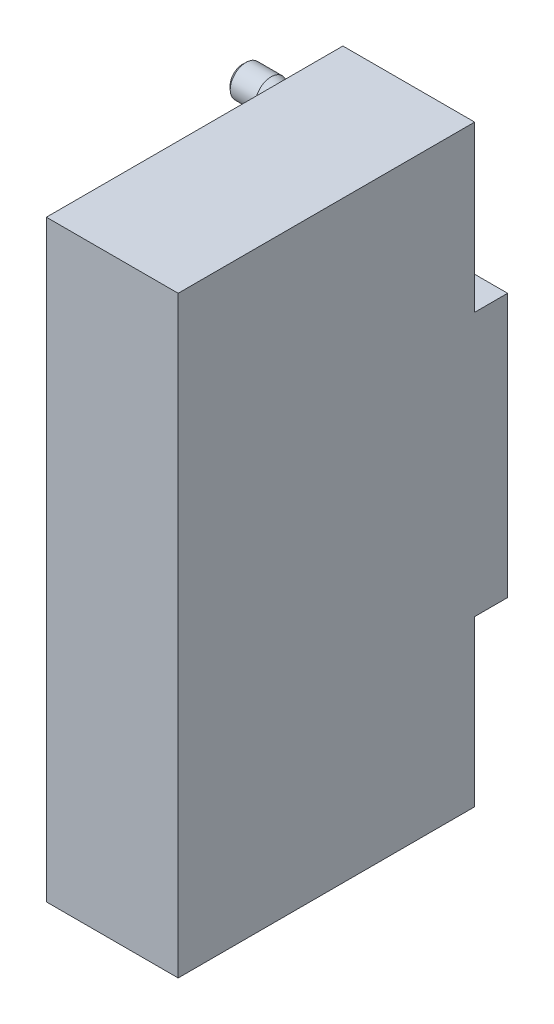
ISO-10303-21;
HEADER;
FILE_DESCRIPTION(('STEP AP214'),'2;1');
FILE_NAME('part.step','',(''),(''),'','','');
FILE_SCHEMA(('AUTOMOTIVE_DESIGN { 1 0 10303 214 1 1 1 1 }'));
ENDSEC;
DATA;
#1=APPLICATION_CONTEXT('core data for automotive mechanical design processes');
#2=APPLICATION_PROTOCOL_DEFINITION('international standard','automotive_design',2000,#1);
#3=PRODUCT_CONTEXT('',#1,'mechanical');
#4=PRODUCT('Part','Part','',(#3));
#5=PRODUCT_RELATED_PRODUCT_CATEGORY('part','',(#4));
#6=PRODUCT_DEFINITION_FORMATION('','',#4);
#7=PRODUCT_DEFINITION_CONTEXT('part definition',#1,'design');
#8=PRODUCT_DEFINITION('design','',#6,#7);
#9=PRODUCT_DEFINITION_SHAPE('','',#8);
#10=(LENGTH_UNIT() NAMED_UNIT(*) SI_UNIT(.MILLI.,.METRE.));
#11=(NAMED_UNIT(*) PLANE_ANGLE_UNIT() SI_UNIT($,.RADIAN.));
#12=(NAMED_UNIT(*) SI_UNIT($,.STERADIAN.) SOLID_ANGLE_UNIT());
#13=UNCERTAINTY_MEASURE_WITH_UNIT(LENGTH_MEASURE(1.E-05),#10,'distance_accuracy_value','');
#14=(GEOMETRIC_REPRESENTATION_CONTEXT(3) GLOBAL_UNCERTAINTY_ASSIGNED_CONTEXT((#13)) GLOBAL_UNIT_ASSIGNED_CONTEXT((#10,
#11,#12)) REPRESENTATION_CONTEXT('',''));
#15=CARTESIAN_POINT('',(0.,0.,0.));
#16=DIRECTION('',(0.,0.,1.));
#17=DIRECTION('',(1.,0.,0.));
#18=AXIS2_PLACEMENT_3D('',#15,#16,#17);
#19=CARTESIAN_POINT('',(-33.6839446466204,35.,1.9002106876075));
#20=DIRECTION('',(1.,0.,0.));
#21=DIRECTION('',(0.,1.,0.));
#22=AXIS2_PLACEMENT_3D('',#19,#20,#21);
#23=CONICAL_SURFACE('',#22,1.34162516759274,0.991977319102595);
#24=CARTESIAN_POINT('',(-33.6839446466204,35.,1.9002106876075));
#25=DIRECTION('',(1.,0.,0.));
#26=DIRECTION('',(0.,1.,0.));
#27=AXIS2_PLACEMENT_3D('',#24,#25,#26);
#28=CIRCLE('',#27,1.34162516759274);
#29=CARTESIAN_POINT('',(-33.6839446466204,36.3416251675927,1.9002106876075));
#30=VERTEX_POINT('',#29);
#31=EDGE_CURVE('E302',#30,#30,#28,.T.);
#32=ORIENTED_EDGE('',*,*,#31,.T.);
#33=EDGE_LOOP('',(#32));
#34=FACE_BOUND('',#33,.T.);
#35=CARTESIAN_POINT('',(-30.1519110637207,28.526560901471,0.));
#36=CARTESIAN_POINT('',(-30.2544568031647,28.6901191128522,0.));
#37=CARTESIAN_POINT('',(-30.3567945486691,28.8538083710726,0.));
#38=CARTESIAN_POINT('',(-30.5609170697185,29.1815403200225,0.));
#39=CARTESIAN_POINT('',(-30.6627018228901,29.3455830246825,0.));
#40=CARTESIAN_POINT('',(-30.8657664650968,29.6744131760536,0.));
#41=CARTESIAN_POINT('',(-30.9670450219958,29.8392014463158,0.));
#42=CARTESIAN_POINT('',(-31.1686855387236,30.1693317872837,0.));
#43=CARTESIAN_POINT('',(-31.2690475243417,30.3346738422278,0.));
#44=CARTESIAN_POINT('',(-31.4827361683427,30.6896316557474,0.));
#45=CARTESIAN_POINT('',(-31.5958788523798,30.8793584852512,0.));
#46=CARTESIAN_POINT('',(-31.8199167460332,31.2601620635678,0.));
#47=CARTESIAN_POINT('',(-31.9308117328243,31.45123894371,0.));
#48=CARTESIAN_POINT('',(-32.1491405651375,31.8351309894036,0.));
#49=CARTESIAN_POINT('',(-32.256577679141,32.0279442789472,0.));
#50=CARTESIAN_POINT('',(-32.4137169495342,32.3193144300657,0.));
#51=CARTESIAN_POINT('',(-32.4654235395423,32.4167887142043,0.));
#52=CARTESIAN_POINT('',(-32.567098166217,32.6126378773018,0.));
#53=CARTESIAN_POINT('',(-32.6170662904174,32.7110127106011,0.));
#54=CARTESIAN_POINT('',(-32.7049791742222,32.8891261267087,0.));
#55=CARTESIAN_POINT('',(-32.7433321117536,32.9686627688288,0.));
#56=CARTESIAN_POINT('',(-32.8182108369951,33.1285975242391,0.));
#57=CARTESIAN_POINT('',(-32.8547365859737,33.2089956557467,0.));
#58=CARTESIAN_POINT('',(-32.9255155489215,33.3709076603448,0.));
#59=CARTESIAN_POINT('',(-32.9597659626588,33.4524227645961,0.));
#60=CARTESIAN_POINT('',(-33.0253036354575,33.6166444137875,0.));
#61=CARTESIAN_POINT('',(-33.0565909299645,33.6993509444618,0.));
#62=CARTESIAN_POINT('',(-33.1142915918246,33.8630449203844,0.));
#63=CARTESIAN_POINT('',(-33.1408419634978,33.9439835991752,0.));
#64=CARTESIAN_POINT('',(-33.1895109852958,34.1072073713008,0.));
#65=CARTESIAN_POINT('',(-33.211629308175,34.189492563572,0.));
#66=CARTESIAN_POINT('',(-33.2503349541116,34.3551459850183,0.));
#67=CARTESIAN_POINT('',(-33.2669367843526,34.4385107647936,0.));
#68=CARTESIAN_POINT('',(-33.2936529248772,34.6062533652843,0.));
#69=CARTESIAN_POINT('',(-33.3037705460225,34.6906306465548,0.));
#70=CARTESIAN_POINT('',(-33.3165443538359,34.8570999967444,0.));
#71=CARTESIAN_POINT('',(-33.3194404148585,34.9391732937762,0.));
#72=CARTESIAN_POINT('',(-33.3182429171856,35.1032861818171,0.));
#73=CARTESIAN_POINT('',(-33.3141477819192,35.1853257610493,0.));
#74=CARTESIAN_POINT('',(-33.2991464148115,35.3502984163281,0.));
#75=CARTESIAN_POINT('',(-33.2881155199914,35.4332199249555,0.));
#76=CARTESIAN_POINT('',(-33.2599254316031,35.5979651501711,0.));
#77=CARTESIAN_POINT('',(-33.2427679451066,35.6797891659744,0.));
#78=CARTESIAN_POINT('',(-33.1895405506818,35.8989115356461,0.));
#79=CARTESIAN_POINT('',(-33.1486323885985,36.035026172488,0.));
#80=CARTESIAN_POINT('',(-33.0565914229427,36.3038052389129,0.));
#81=CARTESIAN_POINT('',(-33.0054451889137,36.4364648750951,0.));
#82=CARTESIAN_POINT('',(-32.8959561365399,36.6997303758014,0.));
#83=CARTESIAN_POINT('',(-32.8375695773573,36.8303177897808,0.));
#84=CARTESIAN_POINT('',(-32.716115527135,37.089188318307,0.));
#85=CARTESIAN_POINT('',(-32.6530504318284,37.2174725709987,0.));
#86=CARTESIAN_POINT('',(-32.5274938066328,37.4647652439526,0.));
#87=CARTESIAN_POINT('',(-32.4651921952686,37.5838707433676,0.));
#88=CARTESIAN_POINT('',(-32.338453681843,37.8209571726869,0.));
#89=CARTESIAN_POINT('',(-32.2740164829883,37.9389379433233,0.));
#90=CARTESIAN_POINT('',(-32.144474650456,38.1723618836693,0.));
#91=CARTESIAN_POINT('',(-32.0793921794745,38.2878173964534,0.));
#92=CARTESIAN_POINT('',(-31.9480410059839,38.5180120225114,0.));
#93=CARTESIAN_POINT('',(-31.8817726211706,38.6327513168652,0.));
#94=CARTESIAN_POINT('',(-31.8150715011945,38.7472339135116,0.));
#95=B_SPLINE_CURVE_WITH_KNOTS('',3,(#35,#36,#37,#38,#39,#40,#41,#42,#43,#44,#45,#46,#47,#48,#49,
#50,#51,#52,#53,#54,#55,#56,#57,#58,#59,#60,#61,#62,#63,#64,#65,#66,#67,#68,#69,#70,#71,#72,#73,
#74,#75,#76,#77,#78,#79,#80,#81,#82,#83,#84,#85,#86,#87,#88,#89,#90,#91,#92,#93,#94),
.UNSPECIFIED.,.F.,.F.,(4,2,2,2,2,2,2,2,2,2,2,2,2,2,2,2,2,2,2,2,2,2,2,2,2,2,2,2,2,4),(0.,
0.579139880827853,1.15830302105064,1.73857010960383,2.31882082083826,2.98151411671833,
3.64427279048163,4.30638541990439,4.63739156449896,4.96838101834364,5.23326542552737,
5.49815544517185,5.76336564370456,6.02857266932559,6.28401860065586,6.53948338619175,
6.79427093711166,7.04892828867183,7.29500689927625,7.5411410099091,7.79183079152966,
8.04245077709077,8.46817320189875,8.8944577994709,9.32345613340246,9.75223628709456,
10.1554558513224,10.5587316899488,10.9563309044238,11.3538251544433),.UNSPECIFIED.);
#96=CARTESIAN_POINT('',(-33.3067449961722,34.7332646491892,0.));
#97=VERTEX_POINT('',#96);
#98=CARTESIAN_POINT('',(-33.3067449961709,35.2667353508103,0.));
#99=VERTEX_POINT('',#98);
#100=EDGE_CURVE('E212',#97,#99,#95,.T.);
#101=ORIENTED_EDGE('',*,*,#100,.F.);
#102=CARTESIAN_POINT('',(-33.3067449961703,35.,1.9002106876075));
#103=DIRECTION('',(1.,0.,0.));
#104=DIRECTION('',(0.,1.,0.));
#105=AXIS2_PLACEMENT_3D('',#102,#103,#104);
#106=CIRCLE('',#105,1.91884038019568);
#107=EDGE_CURVE('E299',#99,#97,#106,.T.);
#108=ORIENTED_EDGE('',*,*,#107,.F.);
#109=EDGE_LOOP('',(#101,#108));
#110=FACE_BOUND('',#109,.T.);
#111=ADVANCED_FACE('F14',(#34,#110),#23,.T.);
#112=CARTESIAN_POINT('',(-33.3067449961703,35.,1.9002106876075));
#113=DIRECTION('',(1.,0.,0.));
#114=DIRECTION('',(0.,1.,0.));
#115=AXIS2_PLACEMENT_3D('',#112,#113,#114);
#116=CONICAL_SURFACE('',#115,1.91884038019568,0.760039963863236);
#117=CARTESIAN_POINT('',(-30.8429668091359,31.1864695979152,0.));
#118=CARTESIAN_POINT('',(-30.9244437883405,31.2730101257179,0.));
#119=CARTESIAN_POINT('',(-31.0056415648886,31.3598158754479,0.));
#120=CARTESIAN_POINT('',(-31.1673305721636,31.5340976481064,0.));
#121=CARTESIAN_POINT('',(-31.2478217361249,31.6215737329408,0.));
#122=CARTESIAN_POINT('',(-31.4082386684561,31.7976541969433,0.));
#123=CARTESIAN_POINT('',(-31.4881611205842,31.886261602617,0.));
#124=CARTESIAN_POINT('',(-31.646902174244,32.0644545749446,0.));
#125=CARTESIAN_POINT('',(-31.7257208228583,32.1540400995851,0.));
#126=CARTESIAN_POINT('',(-31.8862389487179,32.3393719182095,0.));
#127=CARTESIAN_POINT('',(-31.9678595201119,32.4351867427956,0.));
#128=CARTESIAN_POINT('',(-32.1290378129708,32.6285344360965,0.));
#129=CARTESIAN_POINT('',(-32.2085956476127,32.7260672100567,0.));
#130=CARTESIAN_POINT('',(-32.3647943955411,32.9232069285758,0.));
#131=CARTESIAN_POINT('',(-32.4414396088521,33.0228104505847,0.));
#132=CARTESIAN_POINT('',(-32.5908182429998,33.2248944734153,0.));
#133=CARTESIAN_POINT('',(-32.6635528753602,33.3273740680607,0.));
#134=CARTESIAN_POINT('',(-32.7826268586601,33.5052016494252,0.));
#135=CARTESIAN_POINT('',(-32.8303984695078,33.5795855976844,0.));
#136=CARTESIAN_POINT('',(-32.9222269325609,33.7306698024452,0.));
#137=CARTESIAN_POINT('',(-32.9662824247,33.8073708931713,0.));
#138=CARTESIAN_POINT('',(-33.0490653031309,33.9629041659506,0.));
#139=CARTESIAN_POINT('',(-33.0878300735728,34.0417161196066,0.));
#140=CARTESIAN_POINT('',(-33.1586730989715,34.2022432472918,0.));
#141=CARTESIAN_POINT('',(-33.190756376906,34.2839561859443,0.));
#142=CARTESIAN_POINT('',(-33.2533239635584,34.4723128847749,0.));
#143=CARTESIAN_POINT('',(-33.2811927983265,34.5798850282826,0.));
#144=CARTESIAN_POINT('',(-33.3089967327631,34.7434003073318,0.));
#145=CARTESIAN_POINT('',(-33.3159315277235,34.798187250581,0.));
#146=CARTESIAN_POINT('',(-33.324840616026,34.9081757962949,0.));
#147=CARTESIAN_POINT('',(-33.3268150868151,34.9633773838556,0.));
#148=CARTESIAN_POINT('',(-33.3256816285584,35.0738599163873,0.));
#149=CARTESIAN_POINT('',(-33.3225613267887,35.1291407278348,0.));
#150=CARTESIAN_POINT('',(-33.3113924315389,35.2391974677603,0.));
#151=CARTESIAN_POINT('',(-33.3033435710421,35.2939733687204,0.));
#152=CARTESIAN_POINT('',(-33.2826932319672,35.4028484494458,0.));
#153=CARTESIAN_POINT('',(-33.2700758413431,35.4569445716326,0.));
#154=CARTESIAN_POINT('',(-33.2408458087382,35.5640343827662,0.));
#155=CARTESIAN_POINT('',(-33.224232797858,35.6170279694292,0.));
#156=CARTESIAN_POINT('',(-33.1667947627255,35.7813574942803,0.));
#157=CARTESIAN_POINT('',(-33.1199051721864,35.8905765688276,0.));
#158=CARTESIAN_POINT('',(-33.0156353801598,36.1038986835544,0.));
#159=CARTESIAN_POINT('',(-32.95823636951,36.2079921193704,0.));
#160=CARTESIAN_POINT('',(-32.8355616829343,36.4134254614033,0.));
#161=CARTESIAN_POINT('',(-32.7701841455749,36.5147038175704,0.));
#162=CARTESIAN_POINT('',(-32.6684658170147,36.6640273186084,0.));
#163=CARTESIAN_POINT('',(-32.633965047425,36.7133509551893,0.));
#164=CARTESIAN_POINT('',(-32.5639258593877,36.8112544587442,0.));
#165=CARTESIAN_POINT('',(-32.5283874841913,36.8598343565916,0.));
#166=CARTESIAN_POINT('',(-32.4096284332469,37.0191562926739,0.));
#167=CARTESIAN_POINT('',(-32.3245485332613,37.1285116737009,0.));
#168=CARTESIAN_POINT('',(-32.1512190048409,37.3446893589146,0.));
#169=CARTESIAN_POINT('',(-32.0629687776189,37.4515111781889,0.));
#170=CARTESIAN_POINT('',(-31.8841368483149,37.6632835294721,0.));
#171=CARTESIAN_POINT('',(-31.7935538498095,37.7682329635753,0.));
#172=CARTESIAN_POINT('',(-31.6106853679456,37.9766406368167,0.));
#173=CARTESIAN_POINT('',(-31.5183998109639,38.0800988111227,0.));
#174=CARTESIAN_POINT('',(-31.2391326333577,38.3892775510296,0.));
#175=CARTESIAN_POINT('',(-31.0502163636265,38.5932483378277,0.));
#176=CARTESIAN_POINT('',(-30.6692973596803,38.9981339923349,0.));
#177=CARTESIAN_POINT('',(-30.4772957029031,39.1990498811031,0.));
#178=CARTESIAN_POINT('',(-30.1148034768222,39.5743776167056,0.));
#179=CARTESIAN_POINT('',(-29.9445556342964,39.7490242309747,0.));
#180=CARTESIAN_POINT('',(-29.6028571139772,40.0971704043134,0.));
#181=CARTESIAN_POINT('',(-29.4314063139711,40.2706698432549,0.));
#182=CARTESIAN_POINT('',(-29.0884730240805,40.6159275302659,0.));
#183=CARTESIAN_POINT('',(-28.9169949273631,40.7876901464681,0.));
#184=CARTESIAN_POINT('',(-28.5733724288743,41.1305054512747,0.));
#185=CARTESIAN_POINT('',(-28.4012281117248,41.3015582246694,0.));
#186=CARTESIAN_POINT('',(-28.2288350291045,41.4723583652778,0.));
#187=B_SPLINE_CURVE_WITH_KNOTS('',3,(#117,#118,#119,#120,#121,#122,#123,#124,#125,#126,#127,
#128,#129,#130,#131,#132,#133,#134,#135,#136,#137,#138,#139,#140,#141,#142,#143,#144,#145,#146,
#147,#148,#149,#150,#151,#152,#153,#154,#155,#156,#157,#158,#159,#160,#161,#162,#163,#164,#165,
#166,#167,#168,#169,#170,#171,#172,#173,#174,#175,#176,#177,#178,#179,#180,#181,#182,#183,#184,
#185,#186),.UNSPECIFIED.,.F.,.F.,(4,2,2,2,2,2,2,2,2,2,2,2,2,2,2,2,2,2,2,2,2,2,2,2,2,2,2,2,2,2,2,
2,2,2,4),(0.,0.356582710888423,0.713198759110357,1.07117159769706,1.42912912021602,
1.80670766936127,2.18426545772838,2.56124228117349,2.93810163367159,3.20322948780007,
3.46845395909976,3.73169484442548,3.99473711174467,4.32661381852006,4.49209268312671,
4.65756562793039,4.82344102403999,4.98932540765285,5.15579320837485,5.32227638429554,
5.67789990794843,6.03416624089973,6.3955822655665,6.57615103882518,6.75671229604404,
7.17227707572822,7.58792076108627,8.0038006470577,8.41969855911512,9.25368457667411,
10.0873854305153,10.8190687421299,11.5508274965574,12.2789491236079,13.0069811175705),.UNSPECIFIED.);
#188=CARTESIAN_POINT('',(-32.8004213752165,33.5337970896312,0.));
#189=VERTEX_POINT('',#188);
#190=EDGE_CURVE('E216',#189,#97,#187,.T.);
#191=ORIENTED_EDGE('',*,*,#190,.F.);
#192=CARTESIAN_POINT('',(-32.8004213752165,35.,1.9002106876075));
#193=DIRECTION('',(1.,0.,0.));
#194=DIRECTION('',(0.,1.,0.));
#195=AXIS2_PLACEMENT_3D('',#192,#193,#194);
#196=CIRCLE('',#195,2.40011492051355);
#197=CARTESIAN_POINT('',(-32.8004213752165,36.4662029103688,0.));
#198=VERTEX_POINT('',#197);
#199=EDGE_CURVE('E296',#198,#189,#196,.T.);
#200=ORIENTED_EDGE('',*,*,#199,.F.);
#201=EDGE_CURVE('E623',#99,#198,#187,.T.);
#202=ORIENTED_EDGE('',*,*,#201,.F.);
#203=ORIENTED_EDGE('',*,*,#107,.T.);
#204=EDGE_LOOP('',(#191,#200,#202,#203));
#205=FACE_BOUND('',#204,.T.);
#206=ADVANCED_FACE('F507',(#205),#116,.T.);
#207=CARTESIAN_POINT('',(-19.9999999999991,35.,1.9002106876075));
#208=DIRECTION('',(1.,0.,0.));
#209=DIRECTION('',(0.,1.,0.));
#210=AXIS2_PLACEMENT_3D('',#207,#208,#209);
#211=CYLINDRICAL_SURFACE('',#210,2.40011492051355);
#212=DIRECTION('',(1.,0.,0.));
#213=VECTOR('',#212,1.);
#214=CARTESIAN_POINT('',(-19.9999999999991,36.4662029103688,0.));
#215=LINE('',#214,#213);
#216=CARTESIAN_POINT('',(-29.0005746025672,36.4662029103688,0.));
#217=VERTEX_POINT('',#216);
#218=EDGE_CURVE('E35',#198,#217,#215,.T.);
#219=ORIENTED_EDGE('',*,*,#218,.F.);
#220=ORIENTED_EDGE('',*,*,#199,.T.);
#221=DIRECTION('',(1.,0.,0.));
#222=VECTOR('',#221,1.);
#223=CARTESIAN_POINT('',(-19.9999999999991,33.5337970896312,0.));
#224=LINE('',#223,#222);
#225=CARTESIAN_POINT('',(-29.0005746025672,33.5337970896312,0.));
#226=VERTEX_POINT('',#225);
#227=EDGE_CURVE('E592',#226,#189,#224,.F.);
#228=ORIENTED_EDGE('',*,*,#227,.F.);
#229=CARTESIAN_POINT('',(-29.0005746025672,35.,1.9002106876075));
#230=DIRECTION('',(1.,0.,0.));
#231=DIRECTION('',(0.,1.,0.));
#232=AXIS2_PLACEMENT_3D('',#229,#230,#231);
#233=CIRCLE('',#232,2.40011492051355);
#234=EDGE_CURVE('E293',#217,#226,#233,.T.);
#235=ORIENTED_EDGE('',*,*,#234,.F.);
#236=EDGE_LOOP('',(#219,#220,#228,#235));
#237=FACE_BOUND('',#236,.T.);
#238=ADVANCED_FACE('F513',(#237),#211,.T.);
#239=CARTESIAN_POINT('',(-29.0005746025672,35.,1.9002106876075));
#240=DIRECTION('',(-1.,0.,0.));
#241=DIRECTION('',(0.,-1.,0.));
#242=AXIS2_PLACEMENT_3D('',#239,#240,#241);
#243=CONICAL_SURFACE('',#242,2.40011492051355,0.261760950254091);
#244=CARTESIAN_POINT('',(-26.3775138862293,35.,1.9002106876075));
#245=DIRECTION('',(1.,0.,0.));
#246=DIRECTION('',(0.,1.,0.));
#247=AXIS2_PLACEMENT_3D('',#244,#245,#246);
#248=CIRCLE('',#247,1.69737598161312);
#249=CARTESIAN_POINT('',(-26.3775138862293,36.6973759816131,1.9002106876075));
#250=VERTEX_POINT('',#249);
#251=EDGE_CURVE('E290',#250,#250,#248,.T.);
#252=ORIENTED_EDGE('',*,*,#251,.F.);
#253=EDGE_LOOP('',(#252));
#254=FACE_BOUND('',#253,.T.);
#255=CARTESIAN_POINT('',(-31.9489185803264,32.4377161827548,0.));
#256=CARTESIAN_POINT('',(-31.805299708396,32.4856277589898,0.));
#257=CARTESIAN_POINT('',(-31.661817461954,32.5339535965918,0.));
#258=CARTESIAN_POINT('',(-31.3751901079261,32.6316250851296,0.));
#259=CARTESIAN_POINT('',(-31.2320450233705,32.6809708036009,0.));
#260=CARTESIAN_POINT('',(-30.945840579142,32.7809838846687,0.));
#261=CARTESIAN_POINT('',(-30.8027822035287,32.8316540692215,0.));
#262=CARTESIAN_POINT('',(-30.5171990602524,32.9344652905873,0.));
#263=CARTESIAN_POINT('',(-30.3746742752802,32.9866062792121,0.));
#264=CARTESIAN_POINT('',(-30.0903534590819,33.0926896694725,0.));
#265=CARTESIAN_POINT('',(-29.9485571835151,33.1466314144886,0.));
#266=CARTESIAN_POINT('',(-29.6658617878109,33.2568144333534,0.));
#267=CARTESIAN_POINT('',(-29.5249626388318,33.3130556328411,0.));
#268=CARTESIAN_POINT('',(-29.2445230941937,33.4284834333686,0.));
#269=CARTESIAN_POINT('',(-29.1049815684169,33.4876672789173,0.));
#270=CARTESIAN_POINT('',(-28.8276830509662,33.6100585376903,0.));
#271=CARTESIAN_POINT('',(-28.6899256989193,33.67326512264,0.));
#272=CARTESIAN_POINT('',(-28.5019114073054,33.7643878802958,0.));
#273=CARTESIAN_POINT('',(-28.4504591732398,33.789835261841,0.));
#274=CARTESIAN_POINT('',(-28.3480488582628,33.8417108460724,0.));
#275=CARTESIAN_POINT('',(-28.2970908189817,33.8681391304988,0.));
#276=CARTESIAN_POINT('',(-28.1448063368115,33.9492876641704,0.));
#277=CARTESIAN_POINT('',(-28.0443691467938,34.0057287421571,0.));
#278=CARTESIAN_POINT('',(-27.8970267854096,34.095193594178,0.));
#279=CARTESIAN_POINT('',(-27.8486046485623,34.1257174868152,0.));
#280=CARTESIAN_POINT('',(-27.7531191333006,34.1888121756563,0.));
#281=CARTESIAN_POINT('',(-27.7060553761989,34.2213823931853,0.));
#282=CARTESIAN_POINT('',(-27.6139846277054,34.2889782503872,0.));
#283=CARTESIAN_POINT('',(-27.5689705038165,34.3239940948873,0.));
#284=CARTESIAN_POINT('',(-27.4817133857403,34.3972933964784,0.));
#285=CARTESIAN_POINT('',(-27.4394671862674,34.4355729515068,0.));
#286=CARTESIAN_POINT('',(-27.3706621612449,34.5049212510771,0.));
#287=CARTESIAN_POINT('',(-27.3430593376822,34.5349437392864,0.));
#288=CARTESIAN_POINT('',(-27.2909410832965,34.5976912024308,0.));
#289=CARTESIAN_POINT('',(-27.266430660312,34.6304204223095,0.));
#290=CARTESIAN_POINT('',(-27.2216794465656,34.6994074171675,0.));
#291=CARTESIAN_POINT('',(-27.2015026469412,34.7357078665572,0.));
#292=CARTESIAN_POINT('',(-27.1681225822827,34.8113664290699,0.));
#293=CARTESIAN_POINT('',(-27.1548910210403,34.8507113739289,0.));
#294=CARTESIAN_POINT('',(-27.1401198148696,34.9198153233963,0.));
#295=CARTESIAN_POINT('',(-27.136315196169,34.9490870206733,0.));
#296=CARTESIAN_POINT('',(-27.1338345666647,35.007857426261,0.));
#297=CARTESIAN_POINT('',(-27.1351581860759,35.0373561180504,0.));
#298=CARTESIAN_POINT('',(-27.1427587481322,35.0955935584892,0.));
#299=CARTESIAN_POINT('',(-27.1490203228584,35.1243343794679,0.));
#300=CARTESIAN_POINT('',(-27.1657871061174,35.1805268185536,0.));
#301=CARTESIAN_POINT('',(-27.1762945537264,35.2079777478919,0.));
#302=CARTESIAN_POINT('',(-27.2085386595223,35.278477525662,0.));
#303=CARTESIAN_POINT('',(-27.2331503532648,35.3201972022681,0.));
#304=CARTESIAN_POINT('',(-27.2882616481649,35.399573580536,0.));
#305=CARTESIAN_POINT('',(-27.3187845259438,35.4372132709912,0.));
#306=CARTESIAN_POINT('',(-27.39551891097,35.5223080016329,0.));
#307=CARTESIAN_POINT('',(-27.443365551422,35.5682652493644,0.));
#308=CARTESIAN_POINT('',(-27.5431923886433,35.6555100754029,0.));
#309=CARTESIAN_POINT('',(-27.5951815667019,35.6967870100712,0.));
#310=CARTESIAN_POINT('',(-27.7024179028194,35.7762983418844,0.));
#311=CARTESIAN_POINT('',(-27.7576975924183,35.8144884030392,0.));
#312=CARTESIAN_POINT('',(-27.8699810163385,35.888061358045,0.));
#313=CARTESIAN_POINT('',(-27.9269826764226,35.923447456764,0.));
#314=CARTESIAN_POINT('',(-28.052068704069,35.9979044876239,0.));
#315=CARTESIAN_POINT('',(-28.1203884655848,36.0365778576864,0.));
#316=CARTESIAN_POINT('',(-28.2582754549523,36.1116425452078,0.));
#317=CARTESIAN_POINT('',(-28.3278429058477,36.1480334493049,0.));
#318=CARTESIAN_POINT('',(-28.5380001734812,36.2545488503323,0.));
#319=CARTESIAN_POINT('',(-28.6799587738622,36.3219666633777,0.));
#320=CARTESIAN_POINT('',(-28.9665614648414,36.4521837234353,0.));
#321=CARTESIAN_POINT('',(-29.1112134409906,36.5149652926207,0.));
#322=CARTESIAN_POINT('',(-29.4019392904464,36.6369726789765,0.));
#323=CARTESIAN_POINT('',(-29.5480126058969,36.6961998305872,0.));
#324=CARTESIAN_POINT('',(-29.824070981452,36.8052321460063,0.));
#325=CARTESIAN_POINT('',(-29.9539413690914,36.85532955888,0.));
#326=CARTESIAN_POINT('',(-30.2143243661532,36.9538693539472,0.));
#327=CARTESIAN_POINT('',(-30.3448370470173,37.0023115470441,0.));
#328=CARTESIAN_POINT('',(-30.6054210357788,37.0975020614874,0.));
#329=CARTESIAN_POINT('',(-30.7354888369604,37.1442600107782,0.));
#330=CARTESIAN_POINT('',(-30.9959998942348,37.2366487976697,0.));
#331=CARTESIAN_POINT('',(-31.1264430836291,37.2822798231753,0.));
#332=CARTESIAN_POINT('',(-31.2570407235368,37.32745833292,0.));
#333=B_SPLINE_CURVE_WITH_KNOTS('',3,(#255,#256,#257,#258,#259,#260,#261,#262,#263,#264,#265,
#266,#267,#268,#269,#270,#271,#272,#273,#274,#275,#276,#277,#278,#279,#280,#281,#282,#283,#284,
#285,#286,#287,#288,#289,#290,#291,#292,#293,#294,#295,#296,#297,#298,#299,#300,#301,#302,#303,
#304,#305,#306,#307,#308,#309,#310,#311,#312,#313,#314,#315,#316,#317,#318,#319,#320,#321,#322,
#323,#324,#325,#326,#327,#328,#329,#330,#331,#332),.UNSPECIFIED.,.F.,.F.,(4,2,2,2,2,2,2,2,2,2,2,
2,2,2,2,2,2,2,2,2,2,2,2,2,2,2,2,2,2,2,2,2,2,2,2,2,2,2,4),(0.,0.454201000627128,
0.908432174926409,1.36372604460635,1.81900501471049,2.27411974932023,2.72921977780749,
3.18390139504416,3.63848969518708,3.81068310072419,3.9828908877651,4.32830172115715,
4.49998452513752,4.67161899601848,4.84260162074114,5.01338261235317,5.13558373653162,
5.25798028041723,5.38207585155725,5.50566183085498,5.59380081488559,5.68193344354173,
5.76979286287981,5.85769867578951,6.00216838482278,6.14721898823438,6.34574962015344,
6.54472304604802,6.74617654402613,6.94739636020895,7.18285547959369,7.41835711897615,
7.88965781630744,8.36267155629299,8.83550658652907,9.25308792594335,9.67071681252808,
10.0853624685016,10.4999385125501),.UNSPECIFIED.);
#334=EDGE_CURVE('E589',#217,#226,#333,.F.);
#335=ORIENTED_EDGE('',*,*,#334,.F.);
#336=ORIENTED_EDGE('',*,*,#234,.T.);
#337=EDGE_LOOP('',(#335,#336));
#338=FACE_BOUND('',#337,.T.);
#339=ADVANCED_FACE('F608',(#254,#338),#243,.T.);
#340=CARTESIAN_POINT('',(-26.0235946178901,35.,1.9002106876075));
#341=DIRECTION('',(1.,0.,0.));
#342=DIRECTION('',(0.,1.,0.));
#343=AXIS2_PLACEMENT_3D('',#340,#341,#342);
#344=CONICAL_SURFACE('',#343,1.8702954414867,1.37127084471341);
#345=CARTESIAN_POINT('',(-26.0235946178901,35.,1.9002106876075));
#346=DIRECTION('',(1.,0.,0.));
#347=DIRECTION('',(0.,1.,0.));
#348=AXIS2_PLACEMENT_3D('',#345,#346,#347);
#349=CIRCLE('',#348,1.8702954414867);
#350=CARTESIAN_POINT('',(-26.0235946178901,36.8702954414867,1.9002106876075));
#351=VERTEX_POINT('',#350);
#352=EDGE_CURVE('E278',#351,#351,#349,.T.);
#353=ORIENTED_EDGE('',*,*,#352,.T.);
#354=EDGE_LOOP('',(#353));
#355=FACE_BOUND('',#354,.T.);
#356=CARTESIAN_POINT('',(-25.7191824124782,32.2099480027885,0.));
#357=CARTESIAN_POINT('',(-25.7334022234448,32.2950421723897,0.));
#358=CARTESIAN_POINT('',(-25.7474266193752,32.380169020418,0.));
#359=CARTESIAN_POINT('',(-25.7749869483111,32.5505041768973,0.));
#360=CARTESIAN_POINT('',(-25.7885228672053,32.6357124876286,0.));
#361=CARTESIAN_POINT('',(-25.8282737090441,32.8916275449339,0.));
#362=CARTESIAN_POINT('',(-25.8536061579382,33.0624735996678,0.));
#363=CARTESIAN_POINT('',(-25.9005638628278,33.4035386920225,0.));
#364=CARTESIAN_POINT('',(-25.9222124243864,33.5737544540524,0.));
#365=CARTESIAN_POINT('',(-25.9602262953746,33.9147317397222,0.));
#366=CARTESIAN_POINT('',(-25.9765935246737,34.0854930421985,0.));
#367=CARTESIAN_POINT('',(-26.001833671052,34.4284506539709,0.));
#368=CARTESIAN_POINT('',(-26.0106695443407,34.6006498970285,0.));
#369=CARTESIAN_POINT('',(-26.0168838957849,34.8591285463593,0.));
#370=CARTESIAN_POINT('',(-26.0177817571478,34.945329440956,0.));
#371=CARTESIAN_POINT('',(-26.0172030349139,35.1177216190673,0.));
#372=CARTESIAN_POINT('',(-26.0157264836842,35.2039129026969,0.));
#373=CARTESIAN_POINT('',(-26.0077980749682,35.4634004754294,0.));
#374=CARTESIAN_POINT('',(-25.9978239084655,35.6365967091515,0.));
#375=CARTESIAN_POINT('',(-25.9772869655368,35.8959188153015,0.));
#376=CARTESIAN_POINT('',(-25.96951109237,35.9822885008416,0.));
#377=CARTESIAN_POINT('',(-25.9524005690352,36.154857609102,0.));
#378=CARTESIAN_POINT('',(-25.9430662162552,36.2410570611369,0.));
#379=CARTESIAN_POINT('',(-25.9331010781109,36.3271840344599,0.));
#380=B_SPLINE_CURVE_WITH_KNOTS('',3,(#356,#357,#358,#359,#360,#361,#362,#363,#364,#365,#366,
#367,#368,#369,#370,#371,#372,#373,#374,#375,#376,#377,#378,#379),.UNSPECIFIED.,.F.,.F.,(4,2,2,
2,2,2,2,2,2,2,2,4),(0.,0.258821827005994,0.517651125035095,1.03576859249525,1.55047545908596,
2.06499500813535,2.5820309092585,2.8406170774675,3.09919972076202,3.61940295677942,
3.87955103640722,4.13964953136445),.UNSPECIFIED.);
#381=CARTESIAN_POINT('',(-26.0000000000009,34.4192490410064,0.));
#382=VERTEX_POINT('',#381);
#383=CARTESIAN_POINT('',(-26.0000000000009,35.5807509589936,0.));
#384=VERTEX_POINT('',#383);
#385=EDGE_CURVE('E1011',#382,#384,#380,.T.);
#386=ORIENTED_EDGE('',*,*,#385,.F.);
#387=CARTESIAN_POINT('',(-26.0000000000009,35.,1.9002106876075));
#388=DIRECTION('',(1.,0.,0.));
#389=DIRECTION('',(0.,1.,0.));
#390=AXIS2_PLACEMENT_3D('',#387,#388,#389);
#391=CIRCLE('',#390,1.98697567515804);
#392=EDGE_CURVE('E275',#384,#382,#391,.T.);
#393=ORIENTED_EDGE('',*,*,#392,.F.);
#394=EDGE_LOOP('',(#386,#393));
#395=FACE_BOUND('',#394,.T.);
#396=ADVANCED_FACE('F612',(#355,#395),#344,.T.);
#397=CARTESIAN_POINT('',(-26.0000000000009,35.,3.88718636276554));
#398=DIRECTION('',(1.,0.,0.));
#399=DIRECTION('',(0.,1.,0.));
#400=AXIS2_PLACEMENT_3D('',#397,#398,#399);
#401=PLANE('',#400);
#402=DIRECTION('',(0.,1.,0.));
#403=VECTOR('',#402,1.);
#404=CARTESIAN_POINT('',(-26.0000000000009,35.,0.));
#405=LINE('',#404,#403);
#406=CARTESIAN_POINT('',(-26.0000000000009,33.7039228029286,0.));
#407=VERTEX_POINT('',#406);
#408=EDGE_CURVE('E594',#407,#382,#405,.T.);
#409=ORIENTED_EDGE('',*,*,#408,.F.);
#410=CARTESIAN_POINT('',(-26.0000000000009,35.,1.9002106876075));
#411=DIRECTION('',(1.,0.,0.));
#412=DIRECTION('',(0.,1.,0.));
#413=AXIS2_PLACEMENT_3D('',#410,#411,#412);
#414=CIRCLE('',#413,2.30013407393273);
#415=CARTESIAN_POINT('',(-26.0000000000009,36.2960771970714,0.));
#416=VERTEX_POINT('',#415);
#417=EDGE_CURVE('E272',#416,#407,#414,.T.);
#418=ORIENTED_EDGE('',*,*,#417,.F.);
#419=EDGE_CURVE('E1017',#384,#416,#405,.T.);
#420=ORIENTED_EDGE('',*,*,#419,.F.);
#421=ORIENTED_EDGE('',*,*,#392,.T.);
#422=EDGE_LOOP('',(#409,#418,#420,#421));
#423=FACE_BOUND('',#422,.T.);
#424=ADVANCED_FACE('F881',(#423),#401,.F.);
#425=CARTESIAN_POINT('',(-26.0000000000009,35.,1.9002106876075));
#426=DIRECTION('',(1.,0.,0.));
#427=DIRECTION('',(0.,1.,0.));
#428=AXIS2_PLACEMENT_3D('',#425,#426,#427);
#429=CONICAL_SURFACE('',#428,2.30013407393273,0.785398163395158);
#430=CARTESIAN_POINT('',(-23.883993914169,31.0135864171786,0.));
#431=CARTESIAN_POINT('',(-23.9679194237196,31.1065728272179,0.));
#432=CARTESIAN_POINT('',(-24.0515597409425,31.1998189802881,0.));
#433=CARTESIAN_POINT('',(-24.2181116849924,31.3869739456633,0.));
#434=CARTESIAN_POINT('',(-24.3010232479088,31.4808828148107,0.));
#435=CARTESIAN_POINT('',(-24.4661489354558,31.6697238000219,0.));
#436=CARTESIAN_POINT('',(-24.5483608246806,31.7646578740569,0.));
#437=CARTESIAN_POINT('',(-24.7116367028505,31.9555037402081,0.));
#438=CARTESIAN_POINT('',(-24.7927007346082,32.0514154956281,0.));
#439=CARTESIAN_POINT('',(-24.951920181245,32.2427368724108,0.));
#440=CARTESIAN_POINT('',(-25.0301016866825,32.3381247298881,0.));
#441=CARTESIAN_POINT('',(-25.184609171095,32.5303901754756,0.));
#442=CARTESIAN_POINT('',(-25.260935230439,32.6272676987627,0.));
#443=CARTESIAN_POINT('',(-25.4110649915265,32.8228797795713,0.));
#444=CARTESIAN_POINT('',(-25.4848700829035,32.9216132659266,0.));
#445=CARTESIAN_POINT('',(-25.6290622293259,33.121534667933,0.));
#446=CARTESIAN_POINT('',(-25.6994500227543,33.2227220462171,0.));
#447=CARTESIAN_POINT('',(-25.8218843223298,33.4079152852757,0.));
#448=CARTESIAN_POINT('',(-25.8747978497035,33.4913439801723,0.));
#449=CARTESIAN_POINT('',(-25.9763413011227,33.660670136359,0.));
#450=CARTESIAN_POINT('',(-26.0249756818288,33.746564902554,0.));
#451=CARTESIAN_POINT('',(-26.1167587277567,33.9220576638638,0.));
#452=CARTESIAN_POINT('',(-26.1598674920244,34.0116770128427,0.));
#453=CARTESIAN_POINT('',(-26.2184381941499,34.1489010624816,0.));
#454=CARTESIAN_POINT('',(-26.2369737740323,34.1951928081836,0.));
#455=CARTESIAN_POINT('',(-26.2716256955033,34.2887102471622,0.));
#456=CARTESIAN_POINT('',(-26.2877401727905,34.3359366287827,0.));
#457=CARTESIAN_POINT('',(-26.3024541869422,34.383620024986,0.));
#458=B_SPLINE_CURVE_WITH_KNOTS('',3,(#430,#431,#432,#433,#434,#435,#436,#437,#438,#439,#440,
#441,#442,#443,#444,#445,#446,#447,#448,#449,#450,#451,#452,#453,#454,#455,#456,#457),
.UNSPECIFIED.,.F.,.F.,(4,2,2,2,2,2,2,2,2,2,2,2,2,4),(0.,0.375780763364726,0.751594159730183,
1.12833815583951,1.50506806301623,1.87505180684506,2.24501949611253,2.61477984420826,
2.98445993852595,3.28074749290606,3.57672272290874,3.87472739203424,4.02426084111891,
4.17390885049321),.UNSPECIFIED.);
#459=CARTESIAN_POINT('',(-25.9000191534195,33.5337970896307,0.));
#460=VERTEX_POINT('',#459);
#461=EDGE_CURVE('E590',#460,#407,#458,.T.);
#462=ORIENTED_EDGE('',*,*,#461,.F.);
#463=CARTESIAN_POINT('',(-25.9000191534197,35.,1.9002106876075));
#464=DIRECTION('',(1.,0.,0.));
#465=DIRECTION('',(0.,1.,0.));
#466=AXIS2_PLACEMENT_3D('',#463,#464,#465);
#467=CIRCLE('',#466,2.40011492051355);
#468=CARTESIAN_POINT('',(-25.9000191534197,36.4662029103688,0.));
#469=VERTEX_POINT('',#468);
#470=EDGE_CURVE('E269',#469,#460,#467,.T.);
#471=ORIENTED_EDGE('',*,*,#470,.F.);
#472=CARTESIAN_POINT('',(-26.3024541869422,35.616379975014,0.));
#473=CARTESIAN_POINT('',(-26.287740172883,35.6640633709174,0.));
#474=CARTESIAN_POINT('',(-26.271625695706,35.7112897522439,0.));
#475=CARTESIAN_POINT('',(-26.2369737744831,35.8048071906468,0.));
#476=CARTESIAN_POINT('',(-26.2184381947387,35.8510989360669,0.));
#477=CARTESIAN_POINT('',(-26.1598674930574,35.9883229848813,0.));
#478=CARTESIAN_POINT('',(-26.1167587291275,36.0779423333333,0.));
#479=CARTESIAN_POINT('',(-26.0249756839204,36.2534350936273,0.));
#480=CARTESIAN_POINT('',(-25.9763413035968,36.3393298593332,0.));
#481=CARTESIAN_POINT('',(-25.8747978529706,36.508656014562,0.));
#482=CARTESIAN_POINT('',(-25.8218843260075,36.5920847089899,0.));
#483=CARTESIAN_POINT('',(-25.6994500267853,36.7772779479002,0.));
#484=CARTESIAN_POINT('',(-25.629062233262,36.8784653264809,0.));
#485=CARTESIAN_POINT('',(-25.4848700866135,37.0783867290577,0.));
#486=CARTESIAN_POINT('',(-25.4110649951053,37.1771202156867,0.));
#487=CARTESIAN_POINT('',(-25.2609352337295,37.372732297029,0.));
#488=CARTESIAN_POINT('',(-25.1846091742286,37.4696098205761,0.));
#489=CARTESIAN_POINT('',(-25.0301016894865,37.6618752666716,0.));
#490=CARTESIAN_POINT('',(-24.9519201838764,37.7572631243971,0.));
#491=CARTESIAN_POINT('',(-24.7927007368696,37.9485845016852,0.));
#492=CARTESIAN_POINT('',(-24.7116367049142,38.0444962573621,0.));
#493=CARTESIAN_POINT('',(-24.5483608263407,38.2353421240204,0.));
#494=CARTESIAN_POINT('',(-24.4661489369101,38.3302761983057,0.));
#495=CARTESIAN_POINT('',(-24.3010232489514,38.5191171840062,0.));
#496=CARTESIAN_POINT('',(-24.2181116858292,38.6130260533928,0.));
#497=CARTESIAN_POINT('',(-24.0515597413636,38.8001810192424,0.));
#498=CARTESIAN_POINT('',(-23.9679194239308,38.893427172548,0.));
#499=CARTESIAN_POINT('',(-23.883993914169,38.9864135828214,0.));
#500=B_SPLINE_CURVE_WITH_KNOTS('',3,(#472,#473,#474,#475,#476,#477,#478,#479,#480,#481,#482,
#483,#484,#485,#486,#487,#488,#489,#490,#491,#492,#493,#494,#495,#496,#497,#498,#499),
.UNSPECIFIED.,.F.,.F.,(4,2,2,2,2,2,2,2,2,2,2,2,2,4),(0.,0.149648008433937,0.299181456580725,
0.597186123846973,0.893161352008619,1.18944890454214,1.55912899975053,1.92888934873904,
2.29885703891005,2.66884078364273,3.04557069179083,3.42231468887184,3.79812808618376,
4.1739088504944),.UNSPECIFIED.);
#501=EDGE_CURVE('E1019',#416,#469,#500,.T.);
#502=ORIENTED_EDGE('',*,*,#501,.F.);
#503=ORIENTED_EDGE('',*,*,#417,.T.);
#504=EDGE_LOOP('',(#462,#471,#502,#503));
#505=FACE_BOUND('',#504,.T.);
#506=ADVANCED_FACE('F875',(#505),#429,.T.);
#507=CARTESIAN_POINT('',(-19.9999999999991,35.,1.9002106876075));
#508=DIRECTION('',(1.,0.,0.));
#509=DIRECTION('',(0.,1.,0.));
#510=AXIS2_PLACEMENT_3D('',#507,#508,#509);
#511=CYLINDRICAL_SURFACE('',#510,2.40011492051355);
#512=DIRECTION('',(1.,0.,0.));
#513=VECTOR('',#512,1.);
#514=CARTESIAN_POINT('',(-19.9999999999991,36.4662029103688,0.));
#515=LINE('',#514,#513);
#516=CARTESIAN_POINT('',(-20.0999808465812,36.4662029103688,0.));
#517=VERTEX_POINT('',#516);
#518=EDGE_CURVE('E43',#469,#517,#515,.T.);
#519=ORIENTED_EDGE('',*,*,#518,.F.);
#520=ORIENTED_EDGE('',*,*,#470,.T.);
#521=DIRECTION('',(1.,0.,0.));
#522=VECTOR('',#521,1.);
#523=CARTESIAN_POINT('',(-19.9999999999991,33.5337970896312,0.));
#524=LINE('',#523,#522);
#525=CARTESIAN_POINT('',(-20.0999808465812,33.5337970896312,0.));
#526=VERTEX_POINT('',#525);
#527=EDGE_CURVE('E584',#526,#460,#524,.F.);
#528=ORIENTED_EDGE('',*,*,#527,.F.);
#529=CARTESIAN_POINT('',(-20.0999808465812,35.,1.9002106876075));
#530=DIRECTION('',(1.,0.,0.));
#531=DIRECTION('',(0.,1.,0.));
#532=AXIS2_PLACEMENT_3D('',#529,#530,#531);
#533=CIRCLE('',#532,2.40011492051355);
#534=EDGE_CURVE('E263',#517,#526,#533,.T.);
#535=ORIENTED_EDGE('',*,*,#534,.F.);
#536=EDGE_LOOP('',(#519,#520,#528,#535));
#537=FACE_BOUND('',#536,.T.);
#538=ADVANCED_FACE('F463',(#537),#511,.T.);
#539=CARTESIAN_POINT('',(-20.0999808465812,35.,1.9002106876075));
#540=DIRECTION('',(-1.,0.,0.));
#541=DIRECTION('',(0.,-1.,0.));
#542=AXIS2_PLACEMENT_3D('',#539,#540,#541);
#543=CONICAL_SURFACE('',#542,2.40011492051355,0.785398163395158);
#544=CARTESIAN_POINT('',(-19.6975458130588,34.383620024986,0.));
#545=CARTESIAN_POINT('',(-19.7122598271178,34.3359366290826,0.));
#546=CARTESIAN_POINT('',(-19.7283743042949,34.2887102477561,0.));
#547=CARTESIAN_POINT('',(-19.7630262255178,34.1951928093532,0.));
#548=CARTESIAN_POINT('',(-19.7815618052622,34.1489010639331,0.));
#549=CARTESIAN_POINT('',(-19.8401325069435,34.0116770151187,0.));
#550=CARTESIAN_POINT('',(-19.8832412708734,33.9220576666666,0.));
#551=CARTESIAN_POINT('',(-19.9750243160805,33.7465649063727,0.));
#552=CARTESIAN_POINT('',(-20.0236586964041,33.6606701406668,0.));
#553=CARTESIAN_POINT('',(-20.1252021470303,33.491343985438,0.));
#554=CARTESIAN_POINT('',(-20.1781156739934,33.4079152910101,0.));
#555=CARTESIAN_POINT('',(-20.3005499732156,33.2227220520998,0.));
#556=CARTESIAN_POINT('',(-20.3709377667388,33.1215346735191,0.));
#557=CARTESIAN_POINT('',(-20.5151299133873,32.9216132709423,0.));
#558=CARTESIAN_POINT('',(-20.5889350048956,32.8228797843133,0.));
#559=CARTESIAN_POINT('',(-20.7390647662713,32.627267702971,0.));
#560=CARTESIAN_POINT('',(-20.8153908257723,32.5303901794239,0.));
#561=CARTESIAN_POINT('',(-20.9698983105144,32.3381247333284,0.));
#562=CARTESIAN_POINT('',(-21.0480798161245,32.2427368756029,0.));
#563=CARTESIAN_POINT('',(-21.2072992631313,32.0514154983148,0.));
#564=CARTESIAN_POINT('',(-21.2883632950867,31.9555037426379,0.));
#565=CARTESIAN_POINT('',(-21.4516391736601,31.7646578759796,0.));
#566=CARTESIAN_POINT('',(-21.5338510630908,31.6697238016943,0.));
#567=CARTESIAN_POINT('',(-21.6989767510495,31.4808828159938,0.));
#568=CARTESIAN_POINT('',(-21.7818883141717,31.3869739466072,0.));
#569=CARTESIAN_POINT('',(-21.9484402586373,31.1998189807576,0.));
#570=CARTESIAN_POINT('',(-22.0320805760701,31.106572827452,0.));
#571=CARTESIAN_POINT('',(-22.1160060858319,31.0135864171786,0.));
#572=B_SPLINE_CURVE_WITH_KNOTS('',3,(#544,#545,#546,#547,#548,#549,#550,#551,#552,#553,#554,
#555,#556,#557,#558,#559,#560,#561,#562,#563,#564,#565,#566,#567,#568,#569,#570,#571),
.UNSPECIFIED.,.F.,.F.,(4,2,2,2,2,2,2,2,2,2,2,2,2,4),(0.,0.149648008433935,0.29918145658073,
0.59718612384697,0.893161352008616,1.18944890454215,1.55912899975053,1.92888934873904,
2.29885703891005,2.66884078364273,3.04557069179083,3.42231468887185,3.79812808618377,
4.17390885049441),.UNSPECIFIED.);
#573=CARTESIAN_POINT('',(-19.9999999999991,33.7039228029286,0.));
#574=VERTEX_POINT('',#573);
#575=EDGE_CURVE('E9',#574,#526,#572,.T.);
#576=ORIENTED_EDGE('',*,*,#575,.F.);
#577=CARTESIAN_POINT('',(-20.,35.,1.9002106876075));
#578=DIRECTION('',(1.,0.,0.));
#579=DIRECTION('',(0.,1.,0.));
#580=AXIS2_PLACEMENT_3D('',#577,#578,#579);
#581=CIRCLE('',#580,2.30013407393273);
#582=CARTESIAN_POINT('',(-20.,36.2960771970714,0.));
#583=VERTEX_POINT('',#582);
#584=EDGE_CURVE('E200',#583,#574,#581,.T.);
#585=ORIENTED_EDGE('',*,*,#584,.F.);
#586=CARTESIAN_POINT('',(-22.1160060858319,38.9864135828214,0.));
#587=CARTESIAN_POINT('',(-22.0320805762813,38.8934271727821,0.));
#588=CARTESIAN_POINT('',(-21.9484402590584,38.8001810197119,0.));
#589=CARTESIAN_POINT('',(-21.7818883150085,38.6130260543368,0.));
#590=CARTESIAN_POINT('',(-21.6989767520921,38.5191171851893,0.));
#591=CARTESIAN_POINT('',(-21.5338510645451,38.3302761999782,0.));
#592=CARTESIAN_POINT('',(-21.4516391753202,38.2353421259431,0.));
#593=CARTESIAN_POINT('',(-21.2883632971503,38.044496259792,0.));
#594=CARTESIAN_POINT('',(-21.2072992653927,37.9485845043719,0.));
#595=CARTESIAN_POINT('',(-21.0480798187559,37.7572631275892,0.));
#596=CARTESIAN_POINT('',(-20.9698983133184,37.6618752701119,0.));
#597=CARTESIAN_POINT('',(-20.8153908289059,37.4696098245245,0.));
#598=CARTESIAN_POINT('',(-20.7390647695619,37.3727323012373,0.));
#599=CARTESIAN_POINT('',(-20.5889350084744,37.1771202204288,0.));
#600=CARTESIAN_POINT('',(-20.5151299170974,37.0783867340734,0.));
#601=CARTESIAN_POINT('',(-20.370937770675,36.878465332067,0.));
#602=CARTESIAN_POINT('',(-20.3005499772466,36.7772779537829,0.));
#603=CARTESIAN_POINT('',(-20.1781156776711,36.5920847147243,0.));
#604=CARTESIAN_POINT('',(-20.1252021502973,36.5086560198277,0.));
#605=CARTESIAN_POINT('',(-20.0236586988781,36.339329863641,0.));
#606=CARTESIAN_POINT('',(-19.9750243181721,36.253435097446,0.));
#607=CARTESIAN_POINT('',(-19.8832412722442,36.0779423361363,0.));
#608=CARTESIAN_POINT('',(-19.8401325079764,35.9883229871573,0.));
#609=CARTESIAN_POINT('',(-19.7815618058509,35.8510989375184,0.));
#610=CARTESIAN_POINT('',(-19.7630262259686,35.8048071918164,0.));
#611=CARTESIAN_POINT('',(-19.7283743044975,35.7112897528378,0.));
#612=CARTESIAN_POINT('',(-19.7122598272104,35.6640633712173,0.));
#613=CARTESIAN_POINT('',(-19.6975458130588,35.616379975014,0.));
#614=B_SPLINE_CURVE_WITH_KNOTS('',3,(#586,#587,#588,#589,#590,#591,#592,#593,#594,#595,#596,
#597,#598,#599,#600,#601,#602,#603,#604,#605,#606,#607,#608,#609,#610,#611,#612,#613),
.UNSPECIFIED.,.F.,.F.,(4,2,2,2,2,2,2,2,2,2,2,2,2,4),(0.,0.375780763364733,0.751594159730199,
1.12833815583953,1.50506806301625,1.87505180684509,2.24501949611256,2.61477984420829,
2.98445993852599,3.2807474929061,3.57672272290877,3.87472739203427,4.02426084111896,
4.17390885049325),.UNSPECIFIED.);
#615=EDGE_CURVE('E28',#517,#583,#614,.T.);
#616=ORIENTED_EDGE('',*,*,#615,.F.);
#617=ORIENTED_EDGE('',*,*,#534,.T.);
#618=EDGE_LOOP('',(#576,#585,#616,#617));
#619=FACE_BOUND('',#618,.T.);
#620=ADVANCED_FACE('F449',(#619),#543,.T.);
#621=CARTESIAN_POINT('',(-33.6839446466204,-35.,1.9002106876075));
#622=DIRECTION('',(1.,0.,0.));
#623=DIRECTION('',(0.,1.,0.));
#624=AXIS2_PLACEMENT_3D('',#621,#622,#623);
#625=CONICAL_SURFACE('',#624,1.34162516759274,0.991977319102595);
#626=CARTESIAN_POINT('',(-33.6839446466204,-35.,1.9002106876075));
#627=DIRECTION('',(1.,0.,0.));
#628=DIRECTION('',(0.,1.,0.));
#629=AXIS2_PLACEMENT_3D('',#626,#627,#628);
#630=CIRCLE('',#629,1.34162516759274);
#631=CARTESIAN_POINT('',(-33.6839446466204,-33.6583748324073,1.9002106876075));
#632=VERTEX_POINT('',#631);
#633=EDGE_CURVE('E257',#632,#632,#630,.T.);
#634=ORIENTED_EDGE('',*,*,#633,.T.);
#635=EDGE_LOOP('',(#634));
#636=FACE_BOUND('',#635,.T.);
#637=CARTESIAN_POINT('',(-30.1519110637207,-41.473439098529,0.));
#638=CARTESIAN_POINT('',(-30.2544568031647,-41.3098808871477,0.));
#639=CARTESIAN_POINT('',(-30.3567945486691,-41.1461916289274,0.));
#640=CARTESIAN_POINT('',(-30.5609170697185,-40.8184596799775,0.));
#641=CARTESIAN_POINT('',(-30.6627018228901,-40.6544169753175,0.));
#642=CARTESIAN_POINT('',(-30.8657664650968,-40.3255868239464,0.));
#643=CARTESIAN_POINT('',(-30.9670450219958,-40.1607985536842,0.));
#644=CARTESIAN_POINT('',(-31.1686855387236,-39.8306682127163,0.));
#645=CARTESIAN_POINT('',(-31.2690475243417,-39.6653261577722,0.));
#646=CARTESIAN_POINT('',(-31.4827361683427,-39.3103683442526,0.));
#647=CARTESIAN_POINT('',(-31.5958788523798,-39.1206415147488,0.));
#648=CARTESIAN_POINT('',(-31.8199167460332,-38.7398379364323,0.));
#649=CARTESIAN_POINT('',(-31.9308117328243,-38.54876105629,0.));
#650=CARTESIAN_POINT('',(-32.1491405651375,-38.1648690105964,0.));
#651=CARTESIAN_POINT('',(-32.256577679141,-37.9720557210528,0.));
#652=CARTESIAN_POINT('',(-32.4137169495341,-37.6806855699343,0.));
#653=CARTESIAN_POINT('',(-32.4654235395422,-37.5832112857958,0.));
#654=CARTESIAN_POINT('',(-32.567098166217,-37.3873621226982,0.));
#655=CARTESIAN_POINT('',(-32.6170662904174,-37.2889872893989,0.));
#656=CARTESIAN_POINT('',(-32.7049791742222,-37.1108738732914,0.));
#657=CARTESIAN_POINT('',(-32.7433321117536,-37.0313372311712,0.));
#658=CARTESIAN_POINT('',(-32.8182108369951,-36.871402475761,0.));
#659=CARTESIAN_POINT('',(-32.8547365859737,-36.7910043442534,0.));
#660=CARTESIAN_POINT('',(-32.9255155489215,-36.6290923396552,0.));
#661=CARTESIAN_POINT('',(-32.9597659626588,-36.5475772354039,0.));
#662=CARTESIAN_POINT('',(-33.0253036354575,-36.3833555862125,0.));
#663=CARTESIAN_POINT('',(-33.0565909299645,-36.3006490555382,0.));
#664=CARTESIAN_POINT('',(-33.1142915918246,-36.1369550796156,0.));
#665=CARTESIAN_POINT('',(-33.1408419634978,-36.0560164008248,0.));
#666=CARTESIAN_POINT('',(-33.1895109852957,-35.8927926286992,0.));
#667=CARTESIAN_POINT('',(-33.211629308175,-35.810507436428,0.));
#668=CARTESIAN_POINT('',(-33.2503349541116,-35.6448540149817,0.));
#669=CARTESIAN_POINT('',(-33.2669367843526,-35.5614892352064,0.));
#670=CARTESIAN_POINT('',(-33.2936529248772,-35.3937466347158,0.));
#671=CARTESIAN_POINT('',(-33.3037705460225,-35.3093693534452,0.));
#672=CARTESIAN_POINT('',(-33.3165443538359,-35.1429000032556,0.));
#673=CARTESIAN_POINT('',(-33.3194404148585,-35.0608267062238,0.));
#674=CARTESIAN_POINT('',(-33.3182429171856,-34.8967138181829,0.));
#675=CARTESIAN_POINT('',(-33.3141477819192,-34.8146742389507,0.));
#676=CARTESIAN_POINT('',(-33.2991464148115,-34.6497015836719,0.));
#677=CARTESIAN_POINT('',(-33.2881155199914,-34.5667800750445,0.));
#678=CARTESIAN_POINT('',(-33.2599254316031,-34.402034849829,0.));
#679=CARTESIAN_POINT('',(-33.2427679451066,-34.3202108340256,0.));
#680=CARTESIAN_POINT('',(-33.1895405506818,-34.1010884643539,0.));
#681=CARTESIAN_POINT('',(-33.1486323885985,-33.9649738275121,0.));
#682=CARTESIAN_POINT('',(-33.0565914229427,-33.6961947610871,0.));
#683=CARTESIAN_POINT('',(-33.0054451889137,-33.5635351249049,0.));
#684=CARTESIAN_POINT('',(-32.89595613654,-33.3002696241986,0.));
#685=CARTESIAN_POINT('',(-32.8375695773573,-33.1696822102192,0.));
#686=CARTESIAN_POINT('',(-32.716115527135,-32.9108116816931,0.));
#687=CARTESIAN_POINT('',(-32.6530504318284,-32.7825274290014,0.));
#688=CARTESIAN_POINT('',(-32.5274938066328,-32.5352347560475,0.));
#689=CARTESIAN_POINT('',(-32.4651921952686,-32.4161292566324,0.));
#690=CARTESIAN_POINT('',(-32.338453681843,-32.1790428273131,0.));
#691=CARTESIAN_POINT('',(-32.2740164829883,-32.0610620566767,0.));
#692=CARTESIAN_POINT('',(-32.144474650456,-31.8276381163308,0.));
#693=CARTESIAN_POINT('',(-32.0793921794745,-31.7121826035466,0.));
#694=CARTESIAN_POINT('',(-31.9480410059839,-31.4819879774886,0.));
#695=CARTESIAN_POINT('',(-31.8817726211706,-31.3672486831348,0.));
#696=CARTESIAN_POINT('',(-31.8150715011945,-31.2527660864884,0.));
#697=B_SPLINE_CURVE_WITH_KNOTS('',3,(#637,#638,#639,#640,#641,#642,#643,#644,#645,#646,#647,
#648,#649,#650,#651,#652,#653,#654,#655,#656,#657,#658,#659,#660,#661,#662,#663,#664,#665,#666,
#667,#668,#669,#670,#671,#672,#673,#674,#675,#676,#677,#678,#679,#680,#681,#682,#683,#684,#685,
#686,#687,#688,#689,#690,#691,#692,#693,#694,#695,#696),.UNSPECIFIED.,.F.,.F.,(4,2,2,2,2,2,2,2,
2,2,2,2,2,2,2,2,2,2,2,2,2,2,2,2,2,2,2,2,2,4),(0.,0.579139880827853,1.15830302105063,
1.73857010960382,2.31882082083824,2.98151411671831,3.6442727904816,4.30638541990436,
4.63739156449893,4.9683810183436,5.23326542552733,5.49815544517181,5.76336564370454,
6.02857266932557,6.28401860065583,6.53948338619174,6.79427093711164,7.04892828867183,
7.29500689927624,7.5411410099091,7.79183079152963,8.04245077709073,8.46817320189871,
8.89445779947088,9.32345613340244,9.75223628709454,10.1554558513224,10.5587316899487,
10.9563309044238,11.3538251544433),.UNSPECIFIED.);
#698=CARTESIAN_POINT('',(-33.3067449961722,-35.2667353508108,0.));
#699=VERTEX_POINT('',#698);
#700=CARTESIAN_POINT('',(-33.3067449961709,-34.7332646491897,0.));
#701=VERTEX_POINT('',#700);
#702=EDGE_CURVE('E432',#699,#701,#697,.T.);
#703=ORIENTED_EDGE('',*,*,#702,.F.);
#704=CARTESIAN_POINT('',(-33.3067449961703,-35.,1.9002106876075));
#705=DIRECTION('',(1.,0.,0.));
#706=DIRECTION('',(0.,1.,0.));
#707=AXIS2_PLACEMENT_3D('',#704,#705,#706);
#708=CIRCLE('',#707,1.91884038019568);
#709=EDGE_CURVE('E254',#701,#699,#708,.T.);
#710=ORIENTED_EDGE('',*,*,#709,.F.);
#711=EDGE_LOOP('',(#703,#710));
#712=FACE_BOUND('',#711,.T.);
#713=ADVANCED_FACE('F444',(#636,#712),#625,.T.);
#714=CARTESIAN_POINT('',(-33.3067449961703,-35.,1.9002106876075));
#715=DIRECTION('',(1.,0.,0.));
#716=DIRECTION('',(0.,1.,0.));
#717=AXIS2_PLACEMENT_3D('',#714,#715,#716);
#718=CONICAL_SURFACE('',#717,1.91884038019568,0.760039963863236);
#719=CARTESIAN_POINT('',(-30.8429668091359,-38.8135304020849,0.));
#720=CARTESIAN_POINT('',(-30.9244437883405,-38.7269898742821,0.));
#721=CARTESIAN_POINT('',(-31.0056415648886,-38.6401841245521,0.));
#722=CARTESIAN_POINT('',(-31.1673305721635,-38.4659023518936,0.));
#723=CARTESIAN_POINT('',(-31.2478217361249,-38.3784262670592,0.));
#724=CARTESIAN_POINT('',(-31.408238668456,-38.2023458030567,0.));
#725=CARTESIAN_POINT('',(-31.4881611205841,-38.113738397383,0.));
#726=CARTESIAN_POINT('',(-31.646902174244,-37.9355454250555,0.));
#727=CARTESIAN_POINT('',(-31.7257208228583,-37.8459599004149,0.));
#728=CARTESIAN_POINT('',(-31.8862389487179,-37.6606280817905,0.));
#729=CARTESIAN_POINT('',(-31.9678595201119,-37.5648132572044,0.));
#730=CARTESIAN_POINT('',(-32.1290378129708,-37.3714655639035,0.));
#731=CARTESIAN_POINT('',(-32.2085956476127,-37.2739327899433,0.));
#732=CARTESIAN_POINT('',(-32.3647943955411,-37.0767930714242,0.));
#733=CARTESIAN_POINT('',(-32.4414396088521,-36.9771895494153,0.));
#734=CARTESIAN_POINT('',(-32.5908182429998,-36.7751055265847,0.));
#735=CARTESIAN_POINT('',(-32.6635528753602,-36.6726259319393,0.));
#736=CARTESIAN_POINT('',(-32.7826268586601,-36.4947983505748,0.));
#737=CARTESIAN_POINT('',(-32.8303984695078,-36.4204144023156,0.));
#738=CARTESIAN_POINT('',(-32.9222269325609,-36.2693301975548,0.));
#739=CARTESIAN_POINT('',(-32.9662824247,-36.1926291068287,0.));
#740=CARTESIAN_POINT('',(-33.0490653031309,-36.0370958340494,0.));
#741=CARTESIAN_POINT('',(-33.0878300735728,-35.9582838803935,0.));
#742=CARTESIAN_POINT('',(-33.1586730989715,-35.7977567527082,0.));
#743=CARTESIAN_POINT('',(-33.190756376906,-35.7160438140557,0.));
#744=CARTESIAN_POINT('',(-33.2533239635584,-35.5276871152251,0.));
#745=CARTESIAN_POINT('',(-33.2811927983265,-35.4201149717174,0.));
#746=CARTESIAN_POINT('',(-33.3089967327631,-35.2565996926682,0.));
#747=CARTESIAN_POINT('',(-33.3159315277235,-35.201812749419,0.));
#748=CARTESIAN_POINT('',(-33.324840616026,-35.0918242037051,0.));
#749=CARTESIAN_POINT('',(-33.3268150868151,-35.0366226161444,0.));
#750=CARTESIAN_POINT('',(-33.3256816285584,-34.9261400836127,0.));
#751=CARTESIAN_POINT('',(-33.3225613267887,-34.8708592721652,0.));
#752=CARTESIAN_POINT('',(-33.3113924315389,-34.7608025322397,0.));
#753=CARTESIAN_POINT('',(-33.3033435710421,-34.7060266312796,0.));
#754=CARTESIAN_POINT('',(-33.2826932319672,-34.5971515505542,0.));
#755=CARTESIAN_POINT('',(-33.2700758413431,-34.5430554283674,0.));
#756=CARTESIAN_POINT('',(-33.2408458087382,-34.4359656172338,0.));
#757=CARTESIAN_POINT('',(-33.224232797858,-34.3829720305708,0.));
#758=CARTESIAN_POINT('',(-33.1667947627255,-34.2186425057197,0.));
#759=CARTESIAN_POINT('',(-33.1199051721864,-34.1094234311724,0.));
#760=CARTESIAN_POINT('',(-33.0156353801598,-33.8961013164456,0.));
#761=CARTESIAN_POINT('',(-32.95823636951,-33.7920078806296,0.));
#762=CARTESIAN_POINT('',(-32.8355616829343,-33.5865745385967,0.));
#763=CARTESIAN_POINT('',(-32.7701841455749,-33.4852961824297,0.));
#764=CARTESIAN_POINT('',(-32.6684658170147,-33.3359726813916,0.));
#765=CARTESIAN_POINT('',(-32.633965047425,-33.2866490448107,0.));
#766=CARTESIAN_POINT('',(-32.5639258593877,-33.1887455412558,0.));
#767=CARTESIAN_POINT('',(-32.5283874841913,-33.1401656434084,0.));
#768=CARTESIAN_POINT('',(-32.4096284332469,-32.9808437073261,0.));
#769=CARTESIAN_POINT('',(-32.3245485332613,-32.8714883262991,0.));
#770=CARTESIAN_POINT('',(-32.1512190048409,-32.6553106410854,0.));
#771=CARTESIAN_POINT('',(-32.0629687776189,-32.5484888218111,0.));
#772=CARTESIAN_POINT('',(-31.8841368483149,-32.3367164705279,0.));
#773=CARTESIAN_POINT('',(-31.7935538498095,-32.2317670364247,0.));
#774=CARTESIAN_POINT('',(-31.6106853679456,-32.0233593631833,0.));
#775=CARTESIAN_POINT('',(-31.5183998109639,-31.9199011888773,0.));
#776=CARTESIAN_POINT('',(-31.2391326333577,-31.6107224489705,0.));
#777=CARTESIAN_POINT('',(-31.0502163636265,-31.4067516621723,0.));
#778=CARTESIAN_POINT('',(-30.6692973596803,-31.0018660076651,0.));
#779=CARTESIAN_POINT('',(-30.4772957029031,-30.8009501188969,0.));
#780=CARTESIAN_POINT('',(-30.1148034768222,-30.4256223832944,0.));
#781=CARTESIAN_POINT('',(-29.9445556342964,-30.2509757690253,0.));
#782=CARTESIAN_POINT('',(-29.6028571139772,-29.9028295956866,0.));
#783=CARTESIAN_POINT('',(-29.4314063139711,-29.7293301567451,0.));
#784=CARTESIAN_POINT('',(-29.0884730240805,-29.3840724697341,0.));
#785=CARTESIAN_POINT('',(-28.9169949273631,-29.2123098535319,0.));
#786=CARTESIAN_POINT('',(-28.5733724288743,-28.8694945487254,0.));
#787=CARTESIAN_POINT('',(-28.4012281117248,-28.6984417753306,0.));
#788=CARTESIAN_POINT('',(-28.2288350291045,-28.5276416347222,0.));
#789=B_SPLINE_CURVE_WITH_KNOTS('',3,(#719,#720,#721,#722,#723,#724,#725,#726,#727,#728,#729,
#730,#731,#732,#733,#734,#735,#736,#737,#738,#739,#740,#741,#742,#743,#744,#745,#746,#747,#748,
#749,#750,#751,#752,#753,#754,#755,#756,#757,#758,#759,#760,#761,#762,#763,#764,#765,#766,#767,
#768,#769,#770,#771,#772,#773,#774,#775,#776,#777,#778,#779,#780,#781,#782,#783,#784,#785,#786,
#787,#788),.UNSPECIFIED.,.F.,.F.,(4,2,2,2,2,2,2,2,2,2,2,2,2,2,2,2,2,2,2,2,2,2,2,2,2,2,2,2,2,2,2,
2,2,2,4),(0.,0.356582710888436,0.71319875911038,1.0711715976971,1.42912912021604,
1.8067076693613,2.18426545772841,2.56124228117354,2.93810163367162,3.20322948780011,
3.4684539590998,3.73169484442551,3.99473711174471,4.3266138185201,4.49209268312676,
4.65756562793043,4.82344102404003,4.9893254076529,5.15579320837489,5.32227638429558,
5.67789990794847,6.03416624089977,6.39558226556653,6.57615103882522,6.75671229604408,
7.17227707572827,7.58792076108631,8.00380064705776,8.41969855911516,9.25368457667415,
10.0873854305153,10.8190687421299,11.5508274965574,12.2789491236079,13.0069811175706),.UNSPECIFIED.);
#790=CARTESIAN_POINT('',(-32.8004213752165,-36.4662029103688,0.));
#791=VERTEX_POINT('',#790);
#792=EDGE_CURVE('E430',#791,#699,#789,.T.);
#793=ORIENTED_EDGE('',*,*,#792,.F.);
#794=CARTESIAN_POINT('',(-32.8004213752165,-35.,1.9002106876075));
#795=DIRECTION('',(1.,0.,0.));
#796=DIRECTION('',(0.,1.,0.));
#797=AXIS2_PLACEMENT_3D('',#794,#795,#796);
#798=CIRCLE('',#797,2.40011492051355);
#799=CARTESIAN_POINT('',(-32.8004213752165,-33.5337970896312,0.));
#800=VERTEX_POINT('',#799);
#801=EDGE_CURVE('E251',#800,#791,#798,.T.);
#802=ORIENTED_EDGE('',*,*,#801,.F.);
#803=EDGE_CURVE('E423',#701,#800,#789,.T.);
#804=ORIENTED_EDGE('',*,*,#803,.F.);
#805=ORIENTED_EDGE('',*,*,#709,.T.);
#806=EDGE_LOOP('',(#793,#802,#804,#805));
#807=FACE_BOUND('',#806,.T.);
#808=ADVANCED_FACE('F439',(#807),#718,.T.);
#809=CARTESIAN_POINT('',(-19.9999999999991,-35.,1.9002106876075));
#810=DIRECTION('',(1.,0.,0.));
#811=DIRECTION('',(0.,1.,0.));
#812=AXIS2_PLACEMENT_3D('',#809,#810,#811);
#813=CYLINDRICAL_SURFACE('',#812,2.40011492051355);
#814=DIRECTION('',(1.,0.,0.));
#815=VECTOR('',#814,1.);
#816=CARTESIAN_POINT('',(-19.9999999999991,-33.5337970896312,0.));
#817=LINE('',#816,#815);
#818=CARTESIAN_POINT('',(-29.0005746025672,-33.5337970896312,0.));
#819=VERTEX_POINT('',#818);
#820=EDGE_CURVE('E431',#800,#819,#817,.T.);
#821=ORIENTED_EDGE('',*,*,#820,.F.);
#822=ORIENTED_EDGE('',*,*,#801,.T.);
#823=DIRECTION('',(1.,0.,0.));
#824=VECTOR('',#823,1.);
#825=CARTESIAN_POINT('',(-19.9999999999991,-36.4662029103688,0.));
#826=LINE('',#825,#824);
#827=CARTESIAN_POINT('',(-29.0005746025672,-36.4662029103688,0.));
#828=VERTEX_POINT('',#827);
#829=EDGE_CURVE('E478',#828,#791,#826,.F.);
#830=ORIENTED_EDGE('',*,*,#829,.F.);
#831=CARTESIAN_POINT('',(-29.0005746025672,-35.,1.9002106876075));
#832=DIRECTION('',(1.,0.,0.));
#833=DIRECTION('',(0.,1.,0.));
#834=AXIS2_PLACEMENT_3D('',#831,#832,#833);
#835=CIRCLE('',#834,2.40011492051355);
#836=EDGE_CURVE('E248',#819,#828,#835,.T.);
#837=ORIENTED_EDGE('',*,*,#836,.F.);
#838=EDGE_LOOP('',(#821,#822,#830,#837));
#839=FACE_BOUND('',#838,.T.);
#840=ADVANCED_FACE('F443',(#839),#813,.T.);
#841=CARTESIAN_POINT('',(-29.0005746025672,-35.,1.9002106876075));
#842=DIRECTION('',(-1.,0.,0.));
#843=DIRECTION('',(0.,-1.,0.));
#844=AXIS2_PLACEMENT_3D('',#841,#842,#843);
#845=CONICAL_SURFACE('',#844,2.40011492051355,0.261760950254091);
#846=CARTESIAN_POINT('',(-26.3775138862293,-35.,1.9002106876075));
#847=DIRECTION('',(1.,0.,0.));
#848=DIRECTION('',(0.,1.,0.));
#849=AXIS2_PLACEMENT_3D('',#846,#847,#848);
#850=CIRCLE('',#849,1.69737598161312);
#851=CARTESIAN_POINT('',(-26.3775138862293,-33.3026240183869,1.9002106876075));
#852=VERTEX_POINT('',#851);
#853=EDGE_CURVE('E245',#852,#852,#850,.T.);
#854=ORIENTED_EDGE('',*,*,#853,.F.);
#855=EDGE_LOOP('',(#854));
#856=FACE_BOUND('',#855,.T.);
#857=CARTESIAN_POINT('',(-31.9489185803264,-37.5622838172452,0.));
#858=CARTESIAN_POINT('',(-31.805299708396,-37.5143722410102,0.));
#859=CARTESIAN_POINT('',(-31.661817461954,-37.4660464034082,0.));
#860=CARTESIAN_POINT('',(-31.3751901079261,-37.3683749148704,0.));
#861=CARTESIAN_POINT('',(-31.2320450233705,-37.3190291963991,0.));
#862=CARTESIAN_POINT('',(-30.9458405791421,-37.2190161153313,0.));
#863=CARTESIAN_POINT('',(-30.8027822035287,-37.1683459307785,0.));
#864=CARTESIAN_POINT('',(-30.5171990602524,-37.0655347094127,0.));
#865=CARTESIAN_POINT('',(-30.3746742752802,-37.0133937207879,0.));
#866=CARTESIAN_POINT('',(-30.090353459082,-36.9073103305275,0.));
#867=CARTESIAN_POINT('',(-29.9485571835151,-36.8533685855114,0.));
#868=CARTESIAN_POINT('',(-29.6658617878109,-36.7431855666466,0.));
#869=CARTESIAN_POINT('',(-29.5249626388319,-36.6869443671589,0.));
#870=CARTESIAN_POINT('',(-29.2445230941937,-36.5715165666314,0.));
#871=CARTESIAN_POINT('',(-29.1049815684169,-36.5123327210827,0.));
#872=CARTESIAN_POINT('',(-28.8276830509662,-36.3899414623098,0.));
#873=CARTESIAN_POINT('',(-28.6899256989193,-36.32673487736,0.));
#874=CARTESIAN_POINT('',(-28.5019114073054,-36.2356121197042,0.));
#875=CARTESIAN_POINT('',(-28.4504591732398,-36.210164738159,0.));
#876=CARTESIAN_POINT('',(-28.3480488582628,-36.1582891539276,0.));
#877=CARTESIAN_POINT('',(-28.2970908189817,-36.1318608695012,0.));
#878=CARTESIAN_POINT('',(-28.1448063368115,-36.0507123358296,0.));
#879=CARTESIAN_POINT('',(-28.0443691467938,-35.9942712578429,0.));
#880=CARTESIAN_POINT('',(-27.8970267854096,-35.904806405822,0.));
#881=CARTESIAN_POINT('',(-27.8486046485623,-35.8742825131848,0.));
#882=CARTESIAN_POINT('',(-27.7531191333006,-35.8111878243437,0.));
#883=CARTESIAN_POINT('',(-27.7060553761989,-35.7786176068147,0.));
#884=CARTESIAN_POINT('',(-27.6139846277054,-35.7110217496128,0.));
#885=CARTESIAN_POINT('',(-27.5689705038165,-35.6760059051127,0.));
#886=CARTESIAN_POINT('',(-27.4817133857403,-35.6027066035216,0.));
#887=CARTESIAN_POINT('',(-27.4394671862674,-35.5644270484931,0.));
#888=CARTESIAN_POINT('',(-27.3706621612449,-35.4950787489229,0.));
#889=CARTESIAN_POINT('',(-27.3430593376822,-35.4650562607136,0.));
#890=CARTESIAN_POINT('',(-27.2909410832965,-35.4023087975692,0.));
#891=CARTESIAN_POINT('',(-27.266430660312,-35.3695795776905,0.));
#892=CARTESIAN_POINT('',(-27.2216794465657,-35.3005925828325,0.));
#893=CARTESIAN_POINT('',(-27.2015026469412,-35.2642921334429,0.));
#894=CARTESIAN_POINT('',(-27.1681225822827,-35.1886335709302,0.));
#895=CARTESIAN_POINT('',(-27.1548910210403,-35.1492886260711,0.));
#896=CARTESIAN_POINT('',(-27.1401198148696,-35.0801846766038,0.));
#897=CARTESIAN_POINT('',(-27.136315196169,-35.0509129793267,0.));
#898=CARTESIAN_POINT('',(-27.1338345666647,-34.9921425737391,0.));
#899=CARTESIAN_POINT('',(-27.1351581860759,-34.9626438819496,0.));
#900=CARTESIAN_POINT('',(-27.1427587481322,-34.9044064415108,0.));
#901=CARTESIAN_POINT('',(-27.1490203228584,-34.8756656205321,0.));
#902=CARTESIAN_POINT('',(-27.1657871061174,-34.8194731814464,0.));
#903=CARTESIAN_POINT('',(-27.1762945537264,-34.7920222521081,0.));
#904=CARTESIAN_POINT('',(-27.2085386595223,-34.721522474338,0.));
#905=CARTESIAN_POINT('',(-27.2331503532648,-34.6798027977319,0.));
#906=CARTESIAN_POINT('',(-27.2882616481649,-34.600426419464,0.));
#907=CARTESIAN_POINT('',(-27.3187845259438,-34.5627867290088,0.));
#908=CARTESIAN_POINT('',(-27.39551891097,-34.4776919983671,0.));
#909=CARTESIAN_POINT('',(-27.443365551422,-34.4317347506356,0.));
#910=CARTESIAN_POINT('',(-27.5431923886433,-34.3444899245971,0.));
#911=CARTESIAN_POINT('',(-27.5951815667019,-34.3032129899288,0.));
#912=CARTESIAN_POINT('',(-27.7024179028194,-34.2237016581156,0.));
#913=CARTESIAN_POINT('',(-27.7576975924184,-34.1855115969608,0.));
#914=CARTESIAN_POINT('',(-27.8699810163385,-34.111938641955,0.));
#915=CARTESIAN_POINT('',(-27.9269826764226,-34.076552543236,0.));
#916=CARTESIAN_POINT('',(-28.052068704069,-34.0020955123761,0.));
#917=CARTESIAN_POINT('',(-28.1203884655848,-33.9634221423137,0.));
#918=CARTESIAN_POINT('',(-28.2582754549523,-33.8883574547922,0.));
#919=CARTESIAN_POINT('',(-28.3278429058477,-33.8519665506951,0.));
#920=CARTESIAN_POINT('',(-28.5380001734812,-33.7454511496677,0.));
#921=CARTESIAN_POINT('',(-28.6799587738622,-33.6780333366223,0.));
#922=CARTESIAN_POINT('',(-28.9665614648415,-33.5478162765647,0.));
#923=CARTESIAN_POINT('',(-29.1112134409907,-33.4850347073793,0.));
#924=CARTESIAN_POINT('',(-29.4019392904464,-33.3630273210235,0.));
#925=CARTESIAN_POINT('',(-29.5480126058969,-33.3038001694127,0.));
#926=CARTESIAN_POINT('',(-29.824070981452,-33.1947678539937,0.));
#927=CARTESIAN_POINT('',(-29.9539413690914,-33.14467044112,0.));
#928=CARTESIAN_POINT('',(-30.2143243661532,-33.0461306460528,0.));
#929=CARTESIAN_POINT('',(-30.3448370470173,-32.9976884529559,0.));
#930=CARTESIAN_POINT('',(-30.6054210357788,-32.9024979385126,0.));
#931=CARTESIAN_POINT('',(-30.7354888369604,-32.8557399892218,0.));
#932=CARTESIAN_POINT('',(-30.9959998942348,-32.7633512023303,0.));
#933=CARTESIAN_POINT('',(-31.1264430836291,-32.7177201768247,0.));
#934=CARTESIAN_POINT('',(-31.2570407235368,-32.67254166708,0.));
#935=B_SPLINE_CURVE_WITH_KNOTS('',3,(#857,#858,#859,#860,#861,#862,#863,#864,#865,#866,#867,
#868,#869,#870,#871,#872,#873,#874,#875,#876,#877,#878,#879,#880,#881,#882,#883,#884,#885,#886,
#887,#888,#889,#890,#891,#892,#893,#894,#895,#896,#897,#898,#899,#900,#901,#902,#903,#904,#905,
#906,#907,#908,#909,#910,#911,#912,#913,#914,#915,#916,#917,#918,#919,#920,#921,#922,#923,#924,
#925,#926,#927,#928,#929,#930,#931,#932,#933,#934),.UNSPECIFIED.,.F.,.F.,(4,2,2,2,2,2,2,2,2,2,2,
2,2,2,2,2,2,2,2,2,2,2,2,2,2,2,2,2,2,2,2,2,2,2,2,2,2,2,4),(0.,0.454201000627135,
0.908432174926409,1.36372604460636,1.81900501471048,2.27411974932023,2.7292197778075,
3.18390139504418,3.63848969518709,3.8106831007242,3.98289088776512,4.32830172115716,
4.49998452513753,4.67161899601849,4.84260162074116,5.01338261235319,5.13558373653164,
5.25798028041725,5.38207585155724,5.50566183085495,5.59380081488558,5.68193344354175,
5.76979286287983,5.85769867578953,6.00216838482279,6.1472189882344,6.34574962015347,
6.54472304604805,6.74617654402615,6.94739636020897,7.18285547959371,7.41835711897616,
7.88965781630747,8.36267155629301,8.8355065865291,9.25308792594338,9.67071681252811,
10.0853624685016,10.4999385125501),.UNSPECIFIED.);
#936=EDGE_CURVE('E415',#819,#828,#935,.F.);
#937=ORIENTED_EDGE('',*,*,#936,.F.);
#938=ORIENTED_EDGE('',*,*,#836,.T.);
#939=EDGE_LOOP('',(#937,#938));
#940=FACE_BOUND('',#939,.T.);
#941=ADVANCED_FACE('F494',(#856,#940),#845,.T.);
#942=CARTESIAN_POINT('',(-26.0235946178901,-35.,1.9002106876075));
#943=DIRECTION('',(1.,0.,0.));
#944=DIRECTION('',(0.,1.,0.));
#945=AXIS2_PLACEMENT_3D('',#942,#943,#944);
#946=CONICAL_SURFACE('',#945,1.8702954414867,1.37127084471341);
#947=CARTESIAN_POINT('',(-26.0235946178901,-35.,1.9002106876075));
#948=DIRECTION('',(1.,0.,0.));
#949=DIRECTION('',(0.,1.,0.));
#950=AXIS2_PLACEMENT_3D('',#947,#948,#949);
#951=CIRCLE('',#950,1.8702954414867);
#952=CARTESIAN_POINT('',(-26.0235946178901,-33.1297045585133,1.9002106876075));
#953=VERTEX_POINT('',#952);
#954=EDGE_CURVE('E233',#953,#953,#951,.T.);
#955=ORIENTED_EDGE('',*,*,#954,.T.);
#956=EDGE_LOOP('',(#955));
#957=FACE_BOUND('',#956,.T.);
#958=CARTESIAN_POINT('',(-25.7191824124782,-37.7900519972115,0.));
#959=CARTESIAN_POINT('',(-25.7334022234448,-37.7049578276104,0.));
#960=CARTESIAN_POINT('',(-25.7474266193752,-37.619830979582,0.));
#961=CARTESIAN_POINT('',(-25.7749869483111,-37.4494958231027,0.));
#962=CARTESIAN_POINT('',(-25.7885228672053,-37.3642875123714,0.));
#963=CARTESIAN_POINT('',(-25.8282737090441,-37.1083724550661,0.));
#964=CARTESIAN_POINT('',(-25.8536061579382,-36.9375264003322,0.));
#965=CARTESIAN_POINT('',(-25.9005638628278,-36.5964613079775,0.));
#966=CARTESIAN_POINT('',(-25.9222124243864,-36.4262455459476,0.));
#967=CARTESIAN_POINT('',(-25.9602262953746,-36.0852682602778,0.));
#968=CARTESIAN_POINT('',(-25.9765935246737,-35.9145069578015,0.));
#969=CARTESIAN_POINT('',(-26.001833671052,-35.5715493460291,0.));
#970=CARTESIAN_POINT('',(-26.0106695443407,-35.3993501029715,0.));
#971=CARTESIAN_POINT('',(-26.0168838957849,-35.1408714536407,0.));
#972=CARTESIAN_POINT('',(-26.0177817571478,-35.054670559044,0.));
#973=CARTESIAN_POINT('',(-26.0172030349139,-34.8822783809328,0.));
#974=CARTESIAN_POINT('',(-26.0157264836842,-34.7960870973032,0.));
#975=CARTESIAN_POINT('',(-26.0077980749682,-34.5365995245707,0.));
#976=CARTESIAN_POINT('',(-25.9978239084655,-34.3634032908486,0.));
#977=CARTESIAN_POINT('',(-25.9772869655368,-34.1040811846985,0.));
#978=CARTESIAN_POINT('',(-25.96951109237,-34.0177114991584,0.));
#979=CARTESIAN_POINT('',(-25.9524005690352,-33.8451423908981,0.));
#980=CARTESIAN_POINT('',(-25.9430662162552,-33.7589429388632,0.));
#981=CARTESIAN_POINT('',(-25.9331010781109,-33.6728159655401,0.));
#982=B_SPLINE_CURVE_WITH_KNOTS('',3,(#958,#959,#960,#961,#962,#963,#964,#965,#966,#967,#968,
#969,#970,#971,#972,#973,#974,#975,#976,#977,#978,#979,#980,#981),.UNSPECIFIED.,.F.,.F.,(4,2,2,
2,2,2,2,2,2,2,2,4),(0.,0.258821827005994,0.517651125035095,1.03576859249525,1.55047545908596,
2.06499500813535,2.58203090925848,2.84061707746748,3.099199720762,3.61940295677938,
3.87955103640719,4.13964953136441),.UNSPECIFIED.);
#983=CARTESIAN_POINT('',(-26.0000000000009,-35.5807509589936,0.));
#984=VERTEX_POINT('',#983);
#985=CARTESIAN_POINT('',(-26.0000000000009,-34.4192490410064,0.));
#986=VERTEX_POINT('',#985);
#987=EDGE_CURVE('E400',#984,#986,#982,.T.);
#988=ORIENTED_EDGE('',*,*,#987,.F.);
#989=CARTESIAN_POINT('',(-26.0000000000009,-35.,1.9002106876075));
#990=DIRECTION('',(1.,0.,0.));
#991=DIRECTION('',(0.,1.,0.));
#992=AXIS2_PLACEMENT_3D('',#989,#990,#991);
#993=CIRCLE('',#992,1.98697567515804);
#994=EDGE_CURVE('E230',#986,#984,#993,.T.);
#995=ORIENTED_EDGE('',*,*,#994,.F.);
#996=EDGE_LOOP('',(#988,#995));
#997=FACE_BOUND('',#996,.T.);
#998=ADVANCED_FACE('F492',(#957,#997),#946,.T.);
#999=CARTESIAN_POINT('',(-26.0000000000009,-35.,3.88718636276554));
#1000=DIRECTION('',(1.,0.,0.));
#1001=DIRECTION('',(0.,1.,0.));
#1002=AXIS2_PLACEMENT_3D('',#999,#1000,#1001);
#1003=PLANE('',#1002);
#1004=DIRECTION('',(0.,1.,0.));
#1005=VECTOR('',#1004,1.);
#1006=CARTESIAN_POINT('',(-26.0000000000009,-35.,0.));
#1007=LINE('',#1006,#1005);
#1008=CARTESIAN_POINT('',(-26.0000000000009,-36.2960771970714,0.));
#1009=VERTEX_POINT('',#1008);
#1010=EDGE_CURVE('E479',#1009,#984,#1007,.T.);
#1011=ORIENTED_EDGE('',*,*,#1010,.F.);
#1012=CARTESIAN_POINT('',(-26.0000000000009,-35.,1.9002106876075));
#1013=DIRECTION('',(1.,0.,0.));
#1014=DIRECTION('',(0.,1.,0.));
#1015=AXIS2_PLACEMENT_3D('',#1012,#1013,#1014);
#1016=CIRCLE('',#1015,2.30013407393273);
#1017=CARTESIAN_POINT('',(-26.0000000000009,-33.7039228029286,0.));
#1018=VERTEX_POINT('',#1017);
#1019=EDGE_CURVE('E227',#1018,#1009,#1016,.T.);
#1020=ORIENTED_EDGE('',*,*,#1019,.F.);
#1021=EDGE_CURVE('E481',#986,#1018,#1007,.T.);
#1022=ORIENTED_EDGE('',*,*,#1021,.F.);
#1023=ORIENTED_EDGE('',*,*,#994,.T.);
#1024=EDGE_LOOP('',(#1011,#1020,#1022,#1023));
#1025=FACE_BOUND('',#1024,.T.);
#1026=ADVANCED_FACE('F489',(#1025),#1003,.F.);
#1027=CARTESIAN_POINT('',(-26.0000000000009,-35.,1.9002106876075));
#1028=DIRECTION('',(1.,0.,0.));
#1029=DIRECTION('',(0.,1.,0.));
#1030=AXIS2_PLACEMENT_3D('',#1027,#1028,#1029);
#1031=CONICAL_SURFACE('',#1030,2.30013407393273,0.785398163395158);
#1032=CARTESIAN_POINT('',(-23.883993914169,-38.9864135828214,0.));
#1033=CARTESIAN_POINT('',(-23.9679194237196,-38.8934271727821,0.));
#1034=CARTESIAN_POINT('',(-24.0515597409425,-38.8001810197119,0.));
#1035=CARTESIAN_POINT('',(-24.2181116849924,-38.6130260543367,0.));
#1036=CARTESIAN_POINT('',(-24.3010232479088,-38.5191171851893,0.));
#1037=CARTESIAN_POINT('',(-24.4661489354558,-38.3302761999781,0.));
#1038=CARTESIAN_POINT('',(-24.5483608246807,-38.2353421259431,0.));
#1039=CARTESIAN_POINT('',(-24.7116367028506,-38.0444962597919,0.));
#1040=CARTESIAN_POINT('',(-24.7927007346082,-37.9485845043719,0.));
#1041=CARTESIAN_POINT('',(-24.951920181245,-37.7572631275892,0.));
#1042=CARTESIAN_POINT('',(-25.0301016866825,-37.6618752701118,0.));
#1043=CARTESIAN_POINT('',(-25.184609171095,-37.4696098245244,0.));
#1044=CARTESIAN_POINT('',(-25.260935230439,-37.3727323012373,0.));
#1045=CARTESIAN_POINT('',(-25.4110649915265,-37.1771202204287,0.));
#1046=CARTESIAN_POINT('',(-25.4848700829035,-37.0783867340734,0.));
#1047=CARTESIAN_POINT('',(-25.6290622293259,-36.878465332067,0.));
#1048=CARTESIAN_POINT('',(-25.6994500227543,-36.7772779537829,0.));
#1049=CARTESIAN_POINT('',(-25.8218843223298,-36.5920847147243,0.));
#1050=CARTESIAN_POINT('',(-25.8747978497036,-36.5086560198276,0.));
#1051=CARTESIAN_POINT('',(-25.9763413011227,-36.339329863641,0.));
#1052=CARTESIAN_POINT('',(-26.0249756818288,-36.253435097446,0.));
#1053=CARTESIAN_POINT('',(-26.1167587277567,-36.0779423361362,0.));
#1054=CARTESIAN_POINT('',(-26.1598674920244,-35.9883229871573,0.));
#1055=CARTESIAN_POINT('',(-26.2184381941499,-35.8510989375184,0.));
#1056=CARTESIAN_POINT('',(-26.2369737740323,-35.8048071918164,0.));
#1057=CARTESIAN_POINT('',(-26.2716256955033,-35.7112897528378,0.));
#1058=CARTESIAN_POINT('',(-26.2877401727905,-35.6640633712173,0.));
#1059=CARTESIAN_POINT('',(-26.3024541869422,-35.616379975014,0.));
#1060=B_SPLINE_CURVE_WITH_KNOTS('',3,(#1032,#1033,#1034,#1035,#1036,#1037,#1038,#1039,#1040,
#1041,#1042,#1043,#1044,#1045,#1046,#1047,#1048,#1049,#1050,#1051,#1052,#1053,#1054,#1055,#1056,
#1057,#1058,#1059),.UNSPECIFIED.,.F.,.F.,(4,2,2,2,2,2,2,2,2,2,2,2,2,4),(0.,0.375780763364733,
0.751594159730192,1.12833815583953,1.50506806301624,1.87505180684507,2.24501949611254,
2.61477984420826,2.98445993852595,3.28074749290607,3.57672272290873,3.87472739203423,
4.02426084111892,4.17390885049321),.UNSPECIFIED.);
#1061=CARTESIAN_POINT('',(-25.9000191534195,-36.4662029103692,0.));
#1062=VERTEX_POINT('',#1061);
#1063=EDGE_CURVE('E408',#1062,#1009,#1060,.T.);
#1064=ORIENTED_EDGE('',*,*,#1063,.F.);
#1065=CARTESIAN_POINT('',(-25.9000191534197,-35.,1.9002106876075));
#1066=DIRECTION('',(1.,0.,0.));
#1067=DIRECTION('',(0.,1.,0.));
#1068=AXIS2_PLACEMENT_3D('',#1065,#1066,#1067);
#1069=CIRCLE('',#1068,2.40011492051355);
#1070=CARTESIAN_POINT('',(-25.9000191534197,-33.5337970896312,0.));
#1071=VERTEX_POINT('',#1070);
#1072=EDGE_CURVE('E214',#1071,#1062,#1069,.T.);
#1073=ORIENTED_EDGE('',*,*,#1072,.F.);
#1074=CARTESIAN_POINT('',(-26.3024541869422,-34.383620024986,0.));
#1075=CARTESIAN_POINT('',(-26.287740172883,-34.3359366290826,0.));
#1076=CARTESIAN_POINT('',(-26.271625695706,-34.2887102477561,0.));
#1077=CARTESIAN_POINT('',(-26.236973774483,-34.1951928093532,0.));
#1078=CARTESIAN_POINT('',(-26.2184381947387,-34.1489010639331,0.));
#1079=CARTESIAN_POINT('',(-26.1598674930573,-34.0116770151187,0.));
#1080=CARTESIAN_POINT('',(-26.1167587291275,-33.9220576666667,0.));
#1081=CARTESIAN_POINT('',(-26.0249756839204,-33.7465649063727,0.));
#1082=CARTESIAN_POINT('',(-25.9763413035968,-33.6606701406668,0.));
#1083=CARTESIAN_POINT('',(-25.8747978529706,-33.491343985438,0.));
#1084=CARTESIAN_POINT('',(-25.8218843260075,-33.4079152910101,0.));
#1085=CARTESIAN_POINT('',(-25.6994500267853,-33.2227220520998,0.));
#1086=CARTESIAN_POINT('',(-25.629062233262,-33.1215346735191,0.));
#1087=CARTESIAN_POINT('',(-25.4848700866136,-32.9216132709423,0.));
#1088=CARTESIAN_POINT('',(-25.4110649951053,-32.8228797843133,0.));
#1089=CARTESIAN_POINT('',(-25.2609352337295,-32.627267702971,0.));
#1090=CARTESIAN_POINT('',(-25.1846091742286,-32.5303901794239,0.));
#1091=CARTESIAN_POINT('',(-25.0301016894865,-32.3381247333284,0.));
#1092=CARTESIAN_POINT('',(-24.9519201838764,-32.2427368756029,0.));
#1093=CARTESIAN_POINT('',(-24.7927007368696,-32.0514154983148,0.));
#1094=CARTESIAN_POINT('',(-24.7116367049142,-31.9555037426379,0.));
#1095=CARTESIAN_POINT('',(-24.5483608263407,-31.7646578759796,0.));
#1096=CARTESIAN_POINT('',(-24.4661489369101,-31.6697238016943,0.));
#1097=CARTESIAN_POINT('',(-24.3010232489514,-31.4808828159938,0.));
#1098=CARTESIAN_POINT('',(-24.2181116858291,-31.3869739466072,0.));
#1099=CARTESIAN_POINT('',(-24.0515597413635,-31.1998189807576,0.));
#1100=CARTESIAN_POINT('',(-23.9679194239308,-31.1065728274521,0.));
#1101=CARTESIAN_POINT('',(-23.883993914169,-31.0135864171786,0.));
#1102=B_SPLINE_CURVE_WITH_KNOTS('',3,(#1074,#1075,#1076,#1077,#1078,#1079,#1080,#1081,#1082,
#1083,#1084,#1085,#1086,#1087,#1088,#1089,#1090,#1091,#1092,#1093,#1094,#1095,#1096,#1097,#1098,
#1099,#1100,#1101),.UNSPECIFIED.,.F.,.F.,(4,2,2,2,2,2,2,2,2,2,2,2,2,4),(0.,0.149648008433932,
0.299181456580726,0.597186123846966,0.893161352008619,1.18944890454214,1.55912899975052,
1.92888934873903,2.29885703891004,2.66884078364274,3.04557069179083,3.42231468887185,
3.79812808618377,4.1739088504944),.UNSPECIFIED.);
#1103=EDGE_CURVE('E390',#1018,#1071,#1102,.T.);
#1104=ORIENTED_EDGE('',*,*,#1103,.F.);
#1105=ORIENTED_EDGE('',*,*,#1019,.T.);
#1106=EDGE_LOOP('',(#1064,#1073,#1104,#1105));
#1107=FACE_BOUND('',#1106,.T.);
#1108=ADVANCED_FACE('F487',(#1107),#1031,.T.);
#1109=CARTESIAN_POINT('',(-19.9999999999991,-35.,1.9002106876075));
#1110=DIRECTION('',(1.,0.,0.));
#1111=DIRECTION('',(0.,1.,0.));
#1112=AXIS2_PLACEMENT_3D('',#1109,#1110,#1111);
#1113=CYLINDRICAL_SURFACE('',#1112,2.40011492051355);
#1114=DIRECTION('',(1.,0.,0.));
#1115=VECTOR('',#1114,1.);
#1116=CARTESIAN_POINT('',(-19.9999999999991,-33.5337970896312,0.));
#1117=LINE('',#1116,#1115);
#1118=CARTESIAN_POINT('',(-20.0999808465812,-33.5337970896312,0.));
#1119=VERTEX_POINT('',#1118);
#1120=EDGE_CURVE('E194',#1071,#1119,#1117,.T.);
#1121=ORIENTED_EDGE('',*,*,#1120,.F.);
#1122=ORIENTED_EDGE('',*,*,#1072,.T.);
#1123=DIRECTION('',(1.,0.,0.));
#1124=VECTOR('',#1123,1.);
#1125=CARTESIAN_POINT('',(-19.9999999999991,-36.4662029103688,0.));
#1126=LINE('',#1125,#1124);
#1127=CARTESIAN_POINT('',(-20.0999808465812,-36.4662029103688,0.));
#1128=VERTEX_POINT('',#1127);
#1129=EDGE_CURVE('E473',#1128,#1062,#1126,.F.);
#1130=ORIENTED_EDGE('',*,*,#1129,.F.);
#1131=CARTESIAN_POINT('',(-20.0999808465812,-35.,1.9002106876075));
#1132=DIRECTION('',(1.,0.,0.));
#1133=DIRECTION('',(0.,1.,0.));
#1134=AXIS2_PLACEMENT_3D('',#1131,#1132,#1133);
#1135=CIRCLE('',#1134,2.40011492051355);
#1136=EDGE_CURVE('E211',#1119,#1128,#1135,.T.);
#1137=ORIENTED_EDGE('',*,*,#1136,.F.);
#1138=EDGE_LOOP('',(#1121,#1122,#1130,#1137));
#1139=FACE_BOUND('',#1138,.T.);
#1140=ADVANCED_FACE('F476',(#1139),#1113,.T.);
#1141=CARTESIAN_POINT('',(-20.0999808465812,-35.,1.9002106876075));
#1142=DIRECTION('',(-1.,0.,0.));
#1143=DIRECTION('',(0.,-1.,0.));
#1144=AXIS2_PLACEMENT_3D('',#1141,#1142,#1143);
#1145=CONICAL_SURFACE('',#1144,2.40011492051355,0.785398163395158);
#1146=CARTESIAN_POINT('',(-19.6975458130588,-35.616379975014,0.));
#1147=CARTESIAN_POINT('',(-19.7122598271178,-35.6640633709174,0.));
#1148=CARTESIAN_POINT('',(-19.7283743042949,-35.7112897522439,0.));
#1149=CARTESIAN_POINT('',(-19.7630262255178,-35.8048071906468,0.));
#1150=CARTESIAN_POINT('',(-19.7815618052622,-35.8510989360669,0.));
#1151=CARTESIAN_POINT('',(-19.8401325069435,-35.9883229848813,0.));
#1152=CARTESIAN_POINT('',(-19.8832412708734,-36.0779423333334,0.));
#1153=CARTESIAN_POINT('',(-19.9750243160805,-36.2534350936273,0.));
#1154=CARTESIAN_POINT('',(-20.0236586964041,-36.3393298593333,0.));
#1155=CARTESIAN_POINT('',(-20.1252021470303,-36.508656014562,0.));
#1156=CARTESIAN_POINT('',(-20.1781156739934,-36.5920847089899,0.));
#1157=CARTESIAN_POINT('',(-20.3005499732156,-36.7772779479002,0.));
#1158=CARTESIAN_POINT('',(-20.3709377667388,-36.8784653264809,0.));
#1159=CARTESIAN_POINT('',(-20.5151299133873,-37.0783867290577,0.));
#1160=CARTESIAN_POINT('',(-20.5889350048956,-37.1771202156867,0.));
#1161=CARTESIAN_POINT('',(-20.7390647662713,-37.372732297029,0.));
#1162=CARTESIAN_POINT('',(-20.8153908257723,-37.4696098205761,0.));
#1163=CARTESIAN_POINT('',(-20.9698983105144,-37.6618752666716,0.));
#1164=CARTESIAN_POINT('',(-21.0480798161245,-37.7572631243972,0.));
#1165=CARTESIAN_POINT('',(-21.2072992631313,-37.9485845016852,0.));
#1166=CARTESIAN_POINT('',(-21.2883632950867,-38.0444962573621,0.));
#1167=CARTESIAN_POINT('',(-21.4516391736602,-38.2353421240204,0.));
#1168=CARTESIAN_POINT('',(-21.5338510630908,-38.3302761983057,0.));
#1169=CARTESIAN_POINT('',(-21.6989767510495,-38.5191171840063,0.));
#1170=CARTESIAN_POINT('',(-21.7818883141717,-38.6130260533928,0.));
#1171=CARTESIAN_POINT('',(-21.9484402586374,-38.8001810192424,0.));
#1172=CARTESIAN_POINT('',(-22.0320805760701,-38.893427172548,0.));
#1173=CARTESIAN_POINT('',(-22.1160060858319,-38.9864135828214,0.));
#1174=B_SPLINE_CURVE_WITH_KNOTS('',3,(#1146,#1147,#1148,#1149,#1150,#1151,#1152,#1153,#1154,
#1155,#1156,#1157,#1158,#1159,#1160,#1161,#1162,#1163,#1164,#1165,#1166,#1167,#1168,#1169,#1170,
#1171,#1172,#1173),.UNSPECIFIED.,.F.,.F.,(4,2,2,2,2,2,2,2,2,2,2,2,2,4),(0.,0.149648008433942,
0.299181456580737,0.597186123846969,0.893161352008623,1.18944890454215,1.55912899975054,
1.92888934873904,2.29885703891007,2.66884078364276,3.04557069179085,3.42231468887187,
3.7981280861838,4.17390885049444),.UNSPECIFIED.);
#1175=CARTESIAN_POINT('',(-19.9999999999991,-36.2960771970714,0.));
#1176=VERTEX_POINT('',#1175);
#1177=EDGE_CURVE('E199',#1176,#1128,#1174,.T.);
#1178=ORIENTED_EDGE('',*,*,#1177,.F.);
#1179=CARTESIAN_POINT('',(-20.,-35.,1.9002106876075));
#1180=DIRECTION('',(1.,0.,0.));
#1181=DIRECTION('',(0.,1.,0.));
#1182=AXIS2_PLACEMENT_3D('',#1179,#1180,#1181);
#1183=CIRCLE('',#1182,2.30013407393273);
#1184=CARTESIAN_POINT('',(-20.,-33.7039228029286,0.));
#1185=VERTEX_POINT('',#1184);
#1186=EDGE_CURVE('E204',#1185,#1176,#1183,.T.);
#1187=ORIENTED_EDGE('',*,*,#1186,.F.);
#1188=CARTESIAN_POINT('',(-22.1160060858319,-31.0135864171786,0.));
#1189=CARTESIAN_POINT('',(-22.0320805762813,-31.1065728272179,0.));
#1190=CARTESIAN_POINT('',(-21.9484402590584,-31.1998189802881,0.));
#1191=CARTESIAN_POINT('',(-21.7818883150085,-31.3869739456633,0.));
#1192=CARTESIAN_POINT('',(-21.6989767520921,-31.4808828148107,0.));
#1193=CARTESIAN_POINT('',(-21.5338510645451,-31.6697238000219,0.));
#1194=CARTESIAN_POINT('',(-21.4516391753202,-31.7646578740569,0.));
#1195=CARTESIAN_POINT('',(-21.2883632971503,-31.9555037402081,0.));
#1196=CARTESIAN_POINT('',(-21.2072992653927,-32.0514154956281,0.));
#1197=CARTESIAN_POINT('',(-21.0480798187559,-32.2427368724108,0.));
#1198=CARTESIAN_POINT('',(-20.9698983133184,-32.3381247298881,0.));
#1199=CARTESIAN_POINT('',(-20.8153908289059,-32.5303901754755,0.));
#1200=CARTESIAN_POINT('',(-20.7390647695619,-32.6272676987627,0.));
#1201=CARTESIAN_POINT('',(-20.5889350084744,-32.8228797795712,0.));
#1202=CARTESIAN_POINT('',(-20.5151299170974,-32.9216132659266,0.));
#1203=CARTESIAN_POINT('',(-20.370937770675,-33.121534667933,0.));
#1204=CARTESIAN_POINT('',(-20.3005499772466,-33.2227220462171,0.));
#1205=CARTESIAN_POINT('',(-20.1781156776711,-33.4079152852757,0.));
#1206=CARTESIAN_POINT('',(-20.1252021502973,-33.4913439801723,0.));
#1207=CARTESIAN_POINT('',(-20.0236586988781,-33.660670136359,0.));
#1208=CARTESIAN_POINT('',(-19.9750243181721,-33.746564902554,0.));
#1209=CARTESIAN_POINT('',(-19.8832412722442,-33.9220576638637,0.));
#1210=CARTESIAN_POINT('',(-19.8401325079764,-34.0116770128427,0.));
#1211=CARTESIAN_POINT('',(-19.7815618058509,-34.1489010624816,0.));
#1212=CARTESIAN_POINT('',(-19.7630262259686,-34.1951928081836,0.));
#1213=CARTESIAN_POINT('',(-19.7283743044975,-34.2887102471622,0.));
#1214=CARTESIAN_POINT('',(-19.7122598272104,-34.3359366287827,0.));
#1215=CARTESIAN_POINT('',(-19.6975458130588,-34.383620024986,0.));
#1216=B_SPLINE_CURVE_WITH_KNOTS('',3,(#1188,#1189,#1190,#1191,#1192,#1193,#1194,#1195,#1196,
#1197,#1198,#1199,#1200,#1201,#1202,#1203,#1204,#1205,#1206,#1207,#1208,#1209,#1210,#1211,#1212,
#1213,#1214,#1215),.UNSPECIFIED.,.F.,.F.,(4,2,2,2,2,2,2,2,2,2,2,2,2,4),(0.,0.375780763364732,
0.751594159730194,1.12833815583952,1.50506806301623,1.87505180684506,2.24501949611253,
2.61477984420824,2.98445993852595,3.28074749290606,3.57672272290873,3.87472739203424,
4.02426084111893,4.17390885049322),.UNSPECIFIED.);
#1217=EDGE_CURVE('E186',#1119,#1185,#1216,.T.);
#1218=ORIENTED_EDGE('',*,*,#1217,.F.);
#1219=ORIENTED_EDGE('',*,*,#1136,.T.);
#1220=EDGE_LOOP('',(#1178,#1187,#1218,#1219));
#1221=FACE_BOUND('',#1220,.T.);
#1222=ADVANCED_FACE('F209',(#1221),#1145,.T.);
#1223=CARTESIAN_POINT('',(-19.9999999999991,45.,-5.));
#1224=DIRECTION('',(1.,0.,0.));
#1225=DIRECTION('',(0.,1.,0.));
#1226=AXIS2_PLACEMENT_3D('',#1223,#1224,#1225);
#1227=PLANE('',#1226);
#1228=ORIENTED_EDGE('',*,*,#1186,.T.);
#1229=DIRECTION('',(0.,-1.,0.));
#1230=VECTOR('',#1229,1.);
#1231=CARTESIAN_POINT('',(-19.9999999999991,-20.,0.));
#1232=LINE('',#1231,#1230);
#1233=CARTESIAN_POINT('',(-19.9999999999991,-45.,0.));
#1234=VERTEX_POINT('',#1233);
#1235=EDGE_CURVE('E207',#1176,#1234,#1232,.T.);
#1236=ORIENTED_EDGE('',*,*,#1235,.T.);
#1237=DIRECTION('',(0.,0.,1.));
#1238=VECTOR('',#1237,1.);
#1239=CARTESIAN_POINT('',(-19.9999999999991,-45.,-5.));
#1240=LINE('',#1239,#1238);
#1241=CARTESIAN_POINT('',(-19.9999999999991,-45.,45.));
#1242=VERTEX_POINT('',#1241);
#1243=EDGE_CURVE('E329',#1234,#1242,#1240,.T.);
#1244=ORIENTED_EDGE('',*,*,#1243,.T.);
#1245=DIRECTION('',(0.,-1.,0.));
#1246=VECTOR('',#1245,1.);
#1247=CARTESIAN_POINT('',(-19.9999999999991,45.,45.));
#1248=LINE('',#1247,#1246);
#1249=CARTESIAN_POINT('',(-19.9999999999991,45.,45.));
#1250=VERTEX_POINT('',#1249);
#1251=EDGE_CURVE('E351',#1250,#1242,#1248,.T.);
#1252=ORIENTED_EDGE('',*,*,#1251,.F.);
#1253=DIRECTION('',(0.,0.,1.));
#1254=VECTOR('',#1253,1.);
#1255=CARTESIAN_POINT('',(-19.9999999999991,45.,-5.));
#1256=LINE('',#1255,#1254);
#1257=CARTESIAN_POINT('',(-19.9999999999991,45.,0.));
#1258=VERTEX_POINT('',#1257);
#1259=EDGE_CURVE('E336',#1258,#1250,#1256,.T.);
#1260=ORIENTED_EDGE('',*,*,#1259,.F.);
#1261=DIRECTION('',(0.,-1.,0.));
#1262=VECTOR('',#1261,1.);
#1263=CARTESIAN_POINT('',(-19.9999999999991,20.,0.));
#1264=LINE('',#1263,#1262);
#1265=EDGE_CURVE('E323',#1258,#583,#1264,.T.);
#1266=ORIENTED_EDGE('',*,*,#1265,.T.);
#1267=ORIENTED_EDGE('',*,*,#584,.T.);
#1268=CARTESIAN_POINT('',(-19.9999999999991,20.,0.));
#1269=VERTEX_POINT('',#1268);
#1270=EDGE_CURVE('E322',#574,#1269,#1264,.T.);
#1271=ORIENTED_EDGE('',*,*,#1270,.T.);
#1272=DIRECTION('',(0.,0.,-1.));
#1273=VECTOR('',#1272,1.);
#1274=CARTESIAN_POINT('',(-19.9999999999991,20.,0.));
#1275=LINE('',#1274,#1273);
#1276=CARTESIAN_POINT('',(-19.9999999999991,20.,-5.));
#1277=VERTEX_POINT('',#1276);
#1278=EDGE_CURVE('E319',#1269,#1277,#1275,.T.);
#1279=ORIENTED_EDGE('',*,*,#1278,.T.);
#1280=DIRECTION('',(0.,-1.,0.));
#1281=VECTOR('',#1280,1.);
#1282=CARTESIAN_POINT('',(-19.9999999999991,45.,-5.));
#1283=LINE('',#1282,#1281);
#1284=CARTESIAN_POINT('',(-19.9999999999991,-20.,-5.));
#1285=VERTEX_POINT('',#1284);
#1286=EDGE_CURVE('E343',#1277,#1285,#1283,.T.);
#1287=ORIENTED_EDGE('',*,*,#1286,.T.);
#1288=DIRECTION('',(0.,0.,1.));
#1289=VECTOR('',#1288,1.);
#1290=CARTESIAN_POINT('',(-19.9999999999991,-20.,0.));
#1291=LINE('',#1290,#1289);
#1292=CARTESIAN_POINT('',(-19.9999999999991,-20.,0.));
#1293=VERTEX_POINT('',#1292);
#1294=EDGE_CURVE('E206',#1285,#1293,#1291,.T.);
#1295=ORIENTED_EDGE('',*,*,#1294,.T.);
#1296=EDGE_CURVE('E191',#1293,#1185,#1232,.T.);
#1297=ORIENTED_EDGE('',*,*,#1296,.T.);
#1298=EDGE_LOOP('',(#1228,#1236,#1244,#1252,#1260,#1266,#1267,#1271,#1279,#1287,#1295,#1297));
#1299=FACE_BOUND('',#1298,.T.);
#1300=ADVANCED_FACE('F16',(#1299),#1227,.F.);
#1301=CARTESIAN_POINT('',(0.,45.,45.));
#1302=DIRECTION('',(0.,0.,-1.));
#1303=DIRECTION('',(-1.,0.,0.));
#1304=AXIS2_PLACEMENT_3D('',#1301,#1302,#1303);
#1305=PLANE('',#1304);
#1306=DIRECTION('',(1.,0.,0.));
#1307=VECTOR('',#1306,1.);
#1308=CARTESIAN_POINT('',(0.,-45.,45.));
#1309=LINE('',#1308,#1307);
#1310=CARTESIAN_POINT('',(0.,-45.,45.));
#1311=VERTEX_POINT('',#1310);
#1312=EDGE_CURVE('E331',#1242,#1311,#1309,.T.);
#1313=ORIENTED_EDGE('',*,*,#1312,.T.);
#1314=DIRECTION('',(0.,-1.,0.));
#1315=VECTOR('',#1314,1.);
#1316=CARTESIAN_POINT('',(0.,45.,45.));
#1317=LINE('',#1316,#1315);
#1318=CARTESIAN_POINT('',(0.,45.,45.));
#1319=VERTEX_POINT('',#1318);
#1320=EDGE_CURVE('E348',#1319,#1311,#1317,.T.);
#1321=ORIENTED_EDGE('',*,*,#1320,.F.);
#1322=DIRECTION('',(1.,0.,0.));
#1323=VECTOR('',#1322,1.);
#1324=CARTESIAN_POINT('',(0.,45.,45.));
#1325=LINE('',#1324,#1323);
#1326=EDGE_CURVE('E338',#1250,#1319,#1325,.T.);
#1327=ORIENTED_EDGE('',*,*,#1326,.F.);
#1328=ORIENTED_EDGE('',*,*,#1251,.T.);
#1329=EDGE_LOOP('',(#1313,#1321,#1327,#1328));
#1330=FACE_BOUND('',#1329,.T.);
#1331=ADVANCED_FACE('F557',(#1330),#1305,.F.);
#1332=CARTESIAN_POINT('',(0.,45.,45.));
#1333=DIRECTION('',(-1.,0.,0.));
#1334=DIRECTION('',(0.,-1.,0.));
#1335=AXIS2_PLACEMENT_3D('',#1332,#1333,#1334);
#1336=PLANE('',#1335);
#1337=DIRECTION('',(0.,0.,-1.));
#1338=VECTOR('',#1337,1.);
#1339=CARTESIAN_POINT('',(0.,-45.,45.));
#1340=LINE('',#1339,#1338);
#1341=CARTESIAN_POINT('',(0.,-45.,0.));
#1342=VERTEX_POINT('',#1341);
#1343=EDGE_CURVE('E333',#1311,#1342,#1340,.T.);
#1344=ORIENTED_EDGE('',*,*,#1343,.T.);
#1345=DIRECTION('',(0.,-1.,0.));
#1346=VECTOR('',#1345,1.);
#1347=CARTESIAN_POINT('',(0.,-20.,0.));
#1348=LINE('',#1347,#1346);
#1349=CARTESIAN_POINT('',(0.,-20.,0.));
#1350=VERTEX_POINT('',#1349);
#1351=EDGE_CURVE('E308',#1350,#1342,#1348,.T.);
#1352=ORIENTED_EDGE('',*,*,#1351,.F.);
#1353=DIRECTION('',(0.,0.,1.));
#1354=VECTOR('',#1353,1.);
#1355=CARTESIAN_POINT('',(0.,-20.,0.));
#1356=LINE('',#1355,#1354);
#1357=CARTESIAN_POINT('',(0.,-20.,-5.));
#1358=VERTEX_POINT('',#1357);
#1359=EDGE_CURVE('E310',#1358,#1350,#1356,.T.);
#1360=ORIENTED_EDGE('',*,*,#1359,.F.);
#1361=DIRECTION('',(0.,-1.,0.));
#1362=VECTOR('',#1361,1.);
#1363=CARTESIAN_POINT('',(0.,45.,-5.));
#1364=LINE('',#1363,#1362);
#1365=CARTESIAN_POINT('',(0.,20.,-5.));
#1366=VERTEX_POINT('',#1365);
#1367=EDGE_CURVE('E345',#1366,#1358,#1364,.T.);
#1368=ORIENTED_EDGE('',*,*,#1367,.F.);
#1369=DIRECTION('',(0.,0.,-1.));
#1370=VECTOR('',#1369,1.);
#1371=CARTESIAN_POINT('',(0.,20.,0.));
#1372=LINE('',#1371,#1370);
#1373=CARTESIAN_POINT('',(0.,20.,0.));
#1374=VERTEX_POINT('',#1373);
#1375=EDGE_CURVE('E315',#1374,#1366,#1372,.T.);
#1376=ORIENTED_EDGE('',*,*,#1375,.F.);
#1377=DIRECTION('',(0.,-1.,0.));
#1378=VECTOR('',#1377,1.);
#1379=CARTESIAN_POINT('',(0.,20.,0.));
#1380=LINE('',#1379,#1378);
#1381=CARTESIAN_POINT('',(0.,45.,0.));
#1382=VERTEX_POINT('',#1381);
#1383=EDGE_CURVE('E317',#1382,#1374,#1380,.T.);
#1384=ORIENTED_EDGE('',*,*,#1383,.F.);
#1385=DIRECTION('',(0.,0.,-1.));
#1386=VECTOR('',#1385,1.);
#1387=CARTESIAN_POINT('',(0.,45.,45.));
#1388=LINE('',#1387,#1386);
#1389=EDGE_CURVE('E340',#1319,#1382,#1388,.T.);
#1390=ORIENTED_EDGE('',*,*,#1389,.F.);
#1391=ORIENTED_EDGE('',*,*,#1320,.T.);
#1392=EDGE_LOOP('',(#1344,#1352,#1360,#1368,#1376,#1384,#1390,#1391));
#1393=FACE_BOUND('',#1392,.T.);
#1394=ADVANCED_FACE('F554',(#1393),#1336,.F.);
#1395=CARTESIAN_POINT('',(-19.9999999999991,45.,-5.));
#1396=DIRECTION('',(0.,0.,1.));
#1397=DIRECTION('',(1.,0.,0.));
#1398=AXIS2_PLACEMENT_3D('',#1395,#1396,#1397);
#1399=PLANE('',#1398);
#1400=ORIENTED_EDGE('',*,*,#1367,.T.);
#1401=DIRECTION('',(-1.,0.,0.));
#1402=VECTOR('',#1401,1.);
#1403=CARTESIAN_POINT('',(-19.9999999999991,-20.,-5.));
#1404=LINE('',#1403,#1402);
#1405=EDGE_CURVE('E266',#1358,#1285,#1404,.T.);
#1406=ORIENTED_EDGE('',*,*,#1405,.T.);
#1407=ORIENTED_EDGE('',*,*,#1286,.F.);
#1408=DIRECTION('',(1.,0.,0.));
#1409=VECTOR('',#1408,1.);
#1410=CARTESIAN_POINT('',(-19.9999999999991,20.,-5.));
#1411=LINE('',#1410,#1409);
#1412=EDGE_CURVE('E357',#1277,#1366,#1411,.T.);
#1413=ORIENTED_EDGE('',*,*,#1412,.T.);
#1414=EDGE_LOOP('',(#1400,#1406,#1407,#1413));
#1415=FACE_BOUND('',#1414,.T.);
#1416=ADVANCED_FACE('F550',(#1415),#1399,.F.);
#1417=CARTESIAN_POINT('',(-19.9999999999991,45.,45.));
#1418=DIRECTION('',(0.,-1.,0.));
#1419=DIRECTION('',(1.,0.,0.));
#1420=AXIS2_PLACEMENT_3D('',#1417,#1418,#1419);
#1421=PLANE('',#1420);
#1422=ORIENTED_EDGE('',*,*,#1389,.T.);
#1423=DIRECTION('',(-1.,0.,0.));
#1424=VECTOR('',#1423,1.);
#1425=CARTESIAN_POINT('',(-19.9999999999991,45.,0.));
#1426=LINE('',#1425,#1424);
#1427=EDGE_CURVE('E354',#1382,#1258,#1426,.T.);
#1428=ORIENTED_EDGE('',*,*,#1427,.T.);
#1429=ORIENTED_EDGE('',*,*,#1259,.T.);
#1430=ORIENTED_EDGE('',*,*,#1326,.T.);
#1431=EDGE_LOOP('',(#1422,#1428,#1429,#1430));
#1432=FACE_BOUND('',#1431,.T.);
#1433=ADVANCED_FACE('F546',(#1432),#1421,.F.);
#1434=CARTESIAN_POINT('',(-19.9999999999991,-45.,45.));
#1435=DIRECTION('',(0.,-1.,0.));
#1436=DIRECTION('',(1.,0.,0.));
#1437=AXIS2_PLACEMENT_3D('',#1434,#1435,#1436);
#1438=PLANE('',#1437);
#1439=DIRECTION('',(-1.,0.,0.));
#1440=VECTOR('',#1439,1.);
#1441=CARTESIAN_POINT('',(-19.9999999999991,-45.,0.));
#1442=LINE('',#1441,#1440);
#1443=EDGE_CURVE('E360',#1342,#1234,#1442,.T.);
#1444=ORIENTED_EDGE('',*,*,#1443,.F.);
#1445=ORIENTED_EDGE('',*,*,#1343,.F.);
#1446=ORIENTED_EDGE('',*,*,#1312,.F.);
#1447=ORIENTED_EDGE('',*,*,#1243,.F.);
#1448=EDGE_LOOP('',(#1444,#1445,#1446,#1447));
#1449=FACE_BOUND('',#1448,.T.);
#1450=ADVANCED_FACE('F542',(#1449),#1438,.T.);
#1451=CARTESIAN_POINT('',(-19.9999999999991,20.,0.));
#1452=DIRECTION('',(0.,-1.,0.));
#1453=DIRECTION('',(1.,0.,0.));
#1454=AXIS2_PLACEMENT_3D('',#1451,#1452,#1453);
#1455=PLANE('',#1454);
#1456=ORIENTED_EDGE('',*,*,#1278,.F.);
#1457=DIRECTION('',(1.,0.,0.));
#1458=VECTOR('',#1457,1.);
#1459=CARTESIAN_POINT('',(-19.9999999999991,20.,0.));
#1460=LINE('',#1459,#1458);
#1461=EDGE_CURVE('E326',#1269,#1374,#1460,.T.);
#1462=ORIENTED_EDGE('',*,*,#1461,.T.);
#1463=ORIENTED_EDGE('',*,*,#1375,.T.);
#1464=ORIENTED_EDGE('',*,*,#1412,.F.);
#1465=EDGE_LOOP('',(#1456,#1462,#1463,#1464));
#1466=FACE_BOUND('',#1465,.T.);
#1467=ADVANCED_FACE('F539',(#1466),#1455,.F.);
#1468=CARTESIAN_POINT('',(-19.9999999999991,20.,0.));
#1469=DIRECTION('',(0.,0.,1.));
#1470=DIRECTION('',(1.,0.,0.));
#1471=AXIS2_PLACEMENT_3D('',#1468,#1469,#1470);
#1472=PLANE('',#1471);
#1473=ORIENTED_EDGE('',*,*,#1383,.T.);
#1474=ORIENTED_EDGE('',*,*,#1461,.F.);
#1475=ORIENTED_EDGE('',*,*,#1270,.F.);
#1476=ORIENTED_EDGE('',*,*,#575,.T.);
#1477=ORIENTED_EDGE('',*,*,#527,.T.);
#1478=ORIENTED_EDGE('',*,*,#461,.T.);
#1479=ORIENTED_EDGE('',*,*,#408,.T.);
#1480=ORIENTED_EDGE('',*,*,#385,.T.);
#1481=ORIENTED_EDGE('',*,*,#419,.T.);
#1482=ORIENTED_EDGE('',*,*,#501,.T.);
#1483=ORIENTED_EDGE('',*,*,#518,.T.);
#1484=ORIENTED_EDGE('',*,*,#615,.T.);
#1485=ORIENTED_EDGE('',*,*,#1265,.F.);
#1486=ORIENTED_EDGE('',*,*,#1427,.F.);
#1487=EDGE_LOOP('',(#1473,#1474,#1475,#1476,#1477,#1478,#1479,#1480,#1481,#1482,#1483,#1484,
#1485,#1486));
#1488=FACE_BOUND('',#1487,.T.);
#1489=ADVANCED_FACE('F533',(#1488),#1472,.F.);
#1490=CARTESIAN_POINT('',(-19.9999999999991,-20.,0.));
#1491=DIRECTION('',(0.,1.,0.));
#1492=DIRECTION('',(-1.,0.,0.));
#1493=AXIS2_PLACEMENT_3D('',#1490,#1491,#1492);
#1494=PLANE('',#1493);
#1495=ORIENTED_EDGE('',*,*,#1359,.T.);
#1496=DIRECTION('',(1.,0.,0.));
#1497=VECTOR('',#1496,1.);
#1498=CARTESIAN_POINT('',(-19.9999999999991,-20.,0.));
#1499=LINE('',#1498,#1497);
#1500=EDGE_CURVE('E313',#1293,#1350,#1499,.T.);
#1501=ORIENTED_EDGE('',*,*,#1500,.F.);
#1502=ORIENTED_EDGE('',*,*,#1294,.F.);
#1503=ORIENTED_EDGE('',*,*,#1405,.F.);
#1504=EDGE_LOOP('',(#1495,#1501,#1502,#1503));
#1505=FACE_BOUND('',#1504,.T.);
#1506=ADVANCED_FACE('F530',(#1505),#1494,.F.);
#1507=CARTESIAN_POINT('',(-19.9999999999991,-20.,0.));
#1508=DIRECTION('',(0.,0.,1.));
#1509=DIRECTION('',(1.,0.,0.));
#1510=AXIS2_PLACEMENT_3D('',#1507,#1508,#1509);
#1511=PLANE('',#1510);
#1512=ORIENTED_EDGE('',*,*,#1443,.T.);
#1513=ORIENTED_EDGE('',*,*,#1235,.F.);
#1514=ORIENTED_EDGE('',*,*,#1177,.T.);
#1515=ORIENTED_EDGE('',*,*,#1129,.T.);
#1516=ORIENTED_EDGE('',*,*,#1063,.T.);
#1517=ORIENTED_EDGE('',*,*,#1010,.T.);
#1518=ORIENTED_EDGE('',*,*,#987,.T.);
#1519=ORIENTED_EDGE('',*,*,#1021,.T.);
#1520=ORIENTED_EDGE('',*,*,#1103,.T.);
#1521=ORIENTED_EDGE('',*,*,#1120,.T.);
#1522=ORIENTED_EDGE('',*,*,#1217,.T.);
#1523=ORIENTED_EDGE('',*,*,#1296,.F.);
#1524=ORIENTED_EDGE('',*,*,#1500,.T.);
#1525=ORIENTED_EDGE('',*,*,#1351,.T.);
#1526=EDGE_LOOP('',(#1512,#1513,#1514,#1515,#1516,#1517,#1518,#1519,#1520,#1521,#1522,#1523,
#1524,#1525));
#1527=FACE_BOUND('',#1526,.T.);
#1528=ADVANCED_FACE('F189',(#1527),#1511,.F.);
#1529=CARTESIAN_POINT('',(-34.0007661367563,35.,1.9002106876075));
#1530=DIRECTION('',(1.,0.,0.));
#1531=DIRECTION('',(0.,1.,0.));
#1532=AXIS2_PLACEMENT_3D('',#1529,#1530,#1531);
#1533=CONICAL_SURFACE('',#1532,2.98155597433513E-13,1.45412243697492);
#1534=CARTESIAN_POINT('',(-33.9194688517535,35.,1.9002106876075));
#1535=DIRECTION('',(1.,0.,0.));
#1536=DIRECTION('',(0.,1.,0.));
#1537=AXIS2_PLACEMENT_3D('',#1534,#1535,#1536);
#1538=CIRCLE('',#1537,0.693626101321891);
#1539=CARTESIAN_POINT('',(-33.9194688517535,35.6936261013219,1.9002106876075));
#1540=VERTEX_POINT('',#1539);
#1541=EDGE_CURVE('E305',#1540,#1540,#1538,.T.);
#1542=ORIENTED_EDGE('',*,*,#1541,.F.);
#1543=EDGE_LOOP('',(#1542));
#1544=FACE_BOUND('',#1543,.T.);
#1545=CARTESIAN_POINT('',(-34.0007661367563,35.,1.9002106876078));
#1546=VERTEX_POINT('',#1545);
#1547=VERTEX_LOOP('',#1546);
#1548=FACE_BOUND('',#1547,.T.);
#1549=ADVANCED_FACE('F525',(#1544,#1548),#1533,.T.);
#1550=CARTESIAN_POINT('',(-33.9194688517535,35.,1.9002106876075));
#1551=DIRECTION('',(1.,0.,0.));
#1552=DIRECTION('',(0.,1.,0.));
#1553=AXIS2_PLACEMENT_3D('',#1550,#1551,#1552);
#1554=CONICAL_SURFACE('',#1553,0.693626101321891,1.2221777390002);
#1555=ORIENTED_EDGE('',*,*,#31,.F.);
#1556=EDGE_LOOP('',(#1555));
#1557=FACE_BOUND('',#1556,.T.);
#1558=ORIENTED_EDGE('',*,*,#1541,.T.);
#1559=EDGE_LOOP('',(#1558));
#1560=FACE_BOUND('',#1559,.T.);
#1561=ADVANCED_FACE('F521',(#1557,#1560),#1554,.T.);
#1562=CARTESIAN_POINT('',(-26.3775138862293,35.,1.9002106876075));
#1563=DIRECTION('',(-1.,0.,0.));
#1564=DIRECTION('',(0.,-1.,0.));
#1565=AXIS2_PLACEMENT_3D('',#1562,#1563,#1564);
#1566=CONICAL_SURFACE('',#1565,1.69737598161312,0.132551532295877);
#1567=CARTESIAN_POINT('',(-26.2999425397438,35.,1.9002106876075));
#1568=DIRECTION('',(1.,0.,0.));
#1569=DIRECTION('',(0.,1.,0.));
#1570=AXIS2_PLACEMENT_3D('',#1567,#1568,#1569);
#1571=CIRCLE('',#1570,1.68703313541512);
#1572=CARTESIAN_POINT('',(-26.2999425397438,36.6870331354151,1.9002106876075));
#1573=VERTEX_POINT('',#1572);
#1574=EDGE_CURVE('E287',#1573,#1573,#1571,.T.);
#1575=ORIENTED_EDGE('',*,*,#1574,.F.);
#1576=EDGE_LOOP('',(#1575));
#1577=FACE_BOUND('',#1576,.T.);
#1578=ORIENTED_EDGE('',*,*,#251,.T.);
#1579=EDGE_LOOP('',(#1578));
#1580=FACE_BOUND('',#1579,.T.);
#1581=ADVANCED_FACE('F524',(#1577,#1580),#1566,.T.);
#1582=CARTESIAN_POINT('',(-26.2999425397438,35.,1.9002106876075));
#1583=DIRECTION('',(1.,0.,0.));
#1584=DIRECTION('',(0.,1.,0.));
#1585=AXIS2_PLACEMENT_3D('',#1582,#1583,#1584);
#1586=CONICAL_SURFACE('',#1585,1.68703313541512,0.19952548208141);
#1587=CARTESIAN_POINT('',(-26.1832623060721,35.,1.9002106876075));
#1588=DIRECTION('',(1.,0.,0.));
#1589=DIRECTION('',(0.,1.,0.));
#1590=AXIS2_PLACEMENT_3D('',#1587,#1588,#1589);
#1591=CIRCLE('',#1590,1.71062775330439);
#1592=CARTESIAN_POINT('',(-26.1832623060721,36.7106277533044,1.9002106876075));
#1593=VERTEX_POINT('',#1592);
#1594=EDGE_CURVE('E284',#1593,#1593,#1591,.T.);
#1595=ORIENTED_EDGE('',*,*,#1594,.F.);
#1596=EDGE_LOOP('',(#1595));
#1597=FACE_BOUND('',#1596,.T.);
#1598=ORIENTED_EDGE('',*,*,#1574,.T.);
#1599=EDGE_LOOP('',(#1598));
#1600=FACE_BOUND('',#1599,.T.);
#1601=ADVANCED_FACE('F706',(#1597,#1600),#1586,.T.);
#1602=CARTESIAN_POINT('',(-26.1832623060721,35.,1.9002106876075));
#1603=DIRECTION('',(1.,0.,0.));
#1604=DIRECTION('',(0.,1.,0.));
#1605=AXIS2_PLACEMENT_3D('',#1602,#1603,#1604);
#1606=CONICAL_SURFACE('',#1605,1.71062775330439,0.593458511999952);
#1607=CARTESIAN_POINT('',(-26.0879141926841,35.,1.9002106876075));
#1608=DIRECTION('',(1.,0.,0.));
#1609=DIRECTION('',(0.,1.,0.));
#1610=AXIS2_PLACEMENT_3D('',#1607,#1608,#1609);
#1611=CIRCLE('',#1610,1.77494732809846);
#1612=CARTESIAN_POINT('',(-26.0879141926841,36.7749473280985,1.9002106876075));
#1613=VERTEX_POINT('',#1612);
#1614=EDGE_CURVE('E281',#1613,#1613,#1611,.T.);
#1615=ORIENTED_EDGE('',*,*,#1614,.F.);
#1616=EDGE_LOOP('',(#1615));
#1617=FACE_BOUND('',#1616,.T.);
#1618=ORIENTED_EDGE('',*,*,#1594,.T.);
#1619=EDGE_LOOP('',(#1618));
#1620=FACE_BOUND('',#1619,.T.);
#1621=ADVANCED_FACE('F697',(#1617,#1620),#1606,.T.);
#1622=CARTESIAN_POINT('',(-26.0879141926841,35.,1.9002106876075));
#1623=DIRECTION('',(1.,0.,0.));
#1624=DIRECTION('',(0.,1.,0.));
#1625=AXIS2_PLACEMENT_3D('',#1622,#1623,#1624);
#1626=CONICAL_SURFACE('',#1625,1.77494732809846,0.977337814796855);
#1627=ORIENTED_EDGE('',*,*,#352,.F.);
#1628=EDGE_LOOP('',(#1627));
#1629=FACE_BOUND('',#1628,.T.);
#1630=ORIENTED_EDGE('',*,*,#1614,.T.);
#1631=EDGE_LOOP('',(#1630));
#1632=FACE_BOUND('',#1631,.T.);
#1633=ADVANCED_FACE('F458',(#1629,#1632),#1626,.T.);
#1634=CARTESIAN_POINT('',(-34.0007661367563,-35.,1.9002106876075));
#1635=DIRECTION('',(1.,0.,0.));
#1636=DIRECTION('',(0.,1.,0.));
#1637=AXIS2_PLACEMENT_3D('',#1634,#1635,#1636);
#1638=CONICAL_SURFACE('',#1637,2.98155597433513E-13,1.45412243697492);
#1639=CARTESIAN_POINT('',(-33.9194688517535,-35.,1.9002106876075));
#1640=DIRECTION('',(1.,0.,0.));
#1641=DIRECTION('',(0.,1.,0.));
#1642=AXIS2_PLACEMENT_3D('',#1639,#1640,#1641);
#1643=CIRCLE('',#1642,0.693626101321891);
#1644=CARTESIAN_POINT('',(-33.9194688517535,-34.3063738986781,1.9002106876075));
#1645=VERTEX_POINT('',#1644);
#1646=EDGE_CURVE('E260',#1645,#1645,#1643,.T.);
#1647=ORIENTED_EDGE('',*,*,#1646,.F.);
#1648=EDGE_LOOP('',(#1647));
#1649=FACE_BOUND('',#1648,.T.);
#1650=CARTESIAN_POINT('',(-34.0007661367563,-35.,1.9002106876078));
#1651=VERTEX_POINT('',#1650);
#1652=VERTEX_LOOP('',#1651);
#1653=FACE_BOUND('',#1652,.T.);
#1654=ADVANCED_FACE('F455',(#1649,#1653),#1638,.T.);
#1655=CARTESIAN_POINT('',(-33.9194688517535,-35.,1.9002106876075));
#1656=DIRECTION('',(1.,0.,0.));
#1657=DIRECTION('',(0.,1.,0.));
#1658=AXIS2_PLACEMENT_3D('',#1655,#1656,#1657);
#1659=CONICAL_SURFACE('',#1658,0.693626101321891,1.2221777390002);
#1660=ORIENTED_EDGE('',*,*,#633,.F.);
#1661=EDGE_LOOP('',(#1660));
#1662=FACE_BOUND('',#1661,.T.);
#1663=ORIENTED_EDGE('',*,*,#1646,.T.);
#1664=EDGE_LOOP('',(#1663));
#1665=FACE_BOUND('',#1664,.T.);
#1666=ADVANCED_FACE('F451',(#1662,#1665),#1659,.T.);
#1667=CARTESIAN_POINT('',(-26.3775138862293,-35.,1.9002106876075));
#1668=DIRECTION('',(-1.,0.,0.));
#1669=DIRECTION('',(0.,-1.,0.));
#1670=AXIS2_PLACEMENT_3D('',#1667,#1668,#1669);
#1671=CONICAL_SURFACE('',#1670,1.69737598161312,0.132551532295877);
#1672=CARTESIAN_POINT('',(-26.2999425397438,-35.,1.9002106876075));
#1673=DIRECTION('',(1.,0.,0.));
#1674=DIRECTION('',(0.,1.,0.));
#1675=AXIS2_PLACEMENT_3D('',#1672,#1673,#1674);
#1676=CIRCLE('',#1675,1.68703313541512);
#1677=CARTESIAN_POINT('',(-26.2999425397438,-33.3129668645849,1.9002106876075));
#1678=VERTEX_POINT('',#1677);
#1679=EDGE_CURVE('E242',#1678,#1678,#1676,.T.);
#1680=ORIENTED_EDGE('',*,*,#1679,.F.);
#1681=EDGE_LOOP('',(#1680));
#1682=FACE_BOUND('',#1681,.T.);
#1683=ORIENTED_EDGE('',*,*,#853,.T.);
#1684=EDGE_LOOP('',(#1683));
#1685=FACE_BOUND('',#1684,.T.);
#1686=ADVANCED_FACE('F454',(#1682,#1685),#1671,.T.);
#1687=CARTESIAN_POINT('',(-26.2999425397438,-35.,1.9002106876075));
#1688=DIRECTION('',(1.,0.,0.));
#1689=DIRECTION('',(0.,1.,0.));
#1690=AXIS2_PLACEMENT_3D('',#1687,#1688,#1689);
#1691=CONICAL_SURFACE('',#1690,1.68703313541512,0.19952548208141);
#1692=CARTESIAN_POINT('',(-26.1832623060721,-35.,1.9002106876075));
#1693=DIRECTION('',(1.,0.,0.));
#1694=DIRECTION('',(0.,1.,0.));
#1695=AXIS2_PLACEMENT_3D('',#1692,#1693,#1694);
#1696=CIRCLE('',#1695,1.71062775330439);
#1697=CARTESIAN_POINT('',(-26.1832623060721,-33.2893722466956,1.9002106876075));
#1698=VERTEX_POINT('',#1697);
#1699=EDGE_CURVE('E239',#1698,#1698,#1696,.T.);
#1700=ORIENTED_EDGE('',*,*,#1699,.F.);
#1701=EDGE_LOOP('',(#1700));
#1702=FACE_BOUND('',#1701,.T.);
#1703=ORIENTED_EDGE('',*,*,#1679,.T.);
#1704=EDGE_LOOP('',(#1703));
#1705=FACE_BOUND('',#1704,.T.);
#1706=ADVANCED_FACE('F660',(#1702,#1705),#1691,.T.);
#1707=CARTESIAN_POINT('',(-26.1832623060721,-35.,1.9002106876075));
#1708=DIRECTION('',(1.,0.,0.));
#1709=DIRECTION('',(0.,1.,0.));
#1710=AXIS2_PLACEMENT_3D('',#1707,#1708,#1709);
#1711=CONICAL_SURFACE('',#1710,1.71062775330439,0.593458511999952);
#1712=CARTESIAN_POINT('',(-26.0879141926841,-35.,1.9002106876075));
#1713=DIRECTION('',(1.,0.,0.));
#1714=DIRECTION('',(0.,1.,0.));
#1715=AXIS2_PLACEMENT_3D('',#1712,#1713,#1714);
#1716=CIRCLE('',#1715,1.77494732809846);
#1717=CARTESIAN_POINT('',(-26.0879141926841,-33.2250526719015,1.9002106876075));
#1718=VERTEX_POINT('',#1717);
#1719=EDGE_CURVE('E236',#1718,#1718,#1716,.T.);
#1720=ORIENTED_EDGE('',*,*,#1719,.F.);
#1721=EDGE_LOOP('',(#1720));
#1722=FACE_BOUND('',#1721,.T.);
#1723=ORIENTED_EDGE('',*,*,#1699,.T.);
#1724=EDGE_LOOP('',(#1723));
#1725=FACE_BOUND('',#1724,.T.);
#1726=ADVANCED_FACE('F652',(#1722,#1725),#1711,.T.);
#1727=CARTESIAN_POINT('',(-26.0879141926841,-35.,1.9002106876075));
#1728=DIRECTION('',(1.,0.,0.));
#1729=DIRECTION('',(0.,1.,0.));
#1730=AXIS2_PLACEMENT_3D('',#1727,#1728,#1729);
#1731=CONICAL_SURFACE('',#1730,1.77494732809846,0.977337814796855);
#1732=ORIENTED_EDGE('',*,*,#954,.F.);
#1733=EDGE_LOOP('',(#1732));
#1734=FACE_BOUND('',#1733,.T.);
#1735=ORIENTED_EDGE('',*,*,#1719,.T.);
#1736=EDGE_LOOP('',(#1735));
#1737=FACE_BOUND('',#1736,.T.);
#1738=ADVANCED_FACE('F380',(#1734,#1737),#1731,.T.);
#1739=CARTESIAN_POINT('',(-34.0007661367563,-45.,0.));
#1740=DIRECTION('',(0.,0.,-1.));
#1741=DIRECTION('',(-1.,0.,0.));
#1742=AXIS2_PLACEMENT_3D('',#1739,#1740,#1741);
#1743=PLANE('',#1742);
#1744=ORIENTED_EDGE('',*,*,#702,.T.);
#1745=ORIENTED_EDGE('',*,*,#803,.T.);
#1746=ORIENTED_EDGE('',*,*,#820,.T.);
#1747=ORIENTED_EDGE('',*,*,#936,.T.);
#1748=ORIENTED_EDGE('',*,*,#829,.T.);
#1749=ORIENTED_EDGE('',*,*,#792,.T.);
#1750=EDGE_LOOP('',(#1744,#1745,#1746,#1747,#1748,#1749));
#1751=FACE_BOUND('',#1750,.T.);
#1752=ADVANCED_FACE('F376',(#1751),#1743,.T.);
#1753=CARTESIAN_POINT('',(-34.0007661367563,20.,0.));
#1754=DIRECTION('',(0.,0.,-1.));
#1755=DIRECTION('',(-1.,0.,0.));
#1756=AXIS2_PLACEMENT_3D('',#1753,#1754,#1755);
#1757=PLANE('',#1756);
#1758=ORIENTED_EDGE('',*,*,#100,.T.);
#1759=ORIENTED_EDGE('',*,*,#201,.T.);
#1760=ORIENTED_EDGE('',*,*,#218,.T.);
#1761=ORIENTED_EDGE('',*,*,#334,.T.);
#1762=ORIENTED_EDGE('',*,*,#227,.T.);
#1763=ORIENTED_EDGE('',*,*,#190,.T.);
#1764=EDGE_LOOP('',(#1758,#1759,#1760,#1761,#1762,#1763));
#1765=FACE_BOUND('',#1764,.T.);
#1766=ADVANCED_FACE('F379',(#1765),#1757,.T.);
#1767=CLOSED_SHELL('',(#111,#206,#238,#339,#396,#424,#506,#538,#620,#713,#808,#840,#941,#998,
#1026,#1108,#1140,#1222,#1300,#1331,#1394,#1416,#1433,#1450,#1467,#1489,#1506,#1528,#1549,#1561,
#1581,#1601,#1621,#1633,#1654,#1666,#1686,#1706,#1726,#1738,#1752,#1766));
#1768=MANIFOLD_SOLID_BREP('B1',#1767);
#1769=ADVANCED_BREP_SHAPE_REPRESENTATION('',(#18,#1768),#14);
#1770=SHAPE_DEFINITION_REPRESENTATION(#9,#1769);
ENDSEC;
END-ISO-10303-21;
